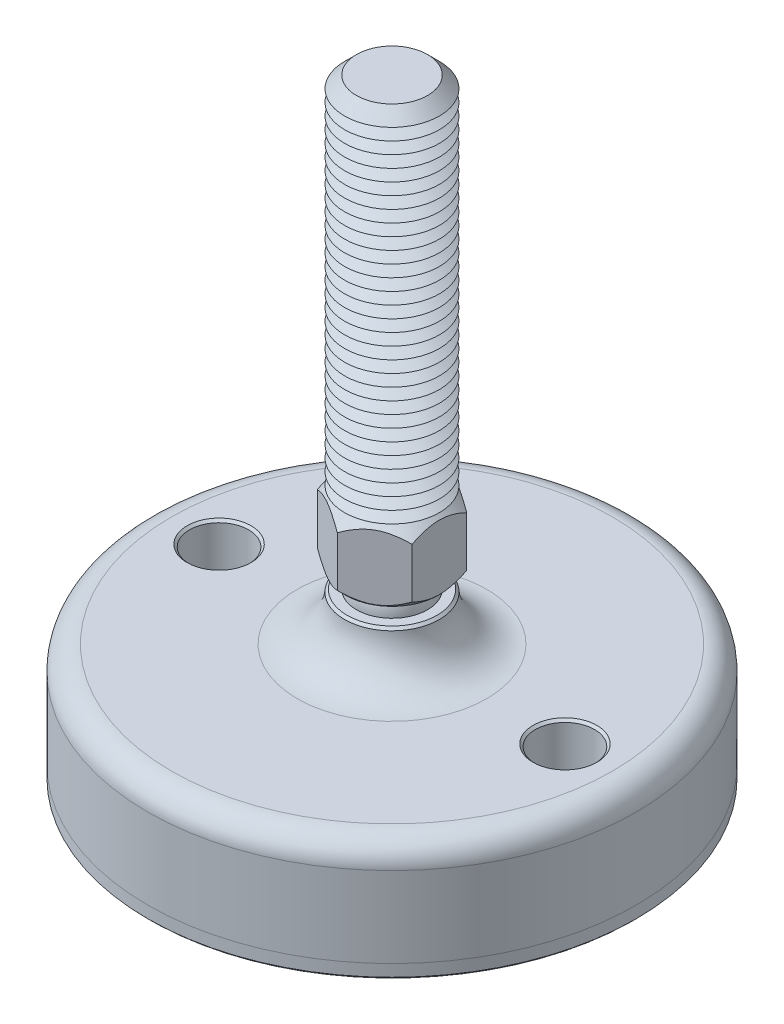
ISO-10303-21;
HEADER;
FILE_DESCRIPTION(('STEP AP214'),'2;1');
FILE_NAME('part.step','',(''),(''),'','','');
FILE_SCHEMA(('AUTOMOTIVE_DESIGN { 1 0 10303 214 1 1 1 1 }'));
ENDSEC;
DATA;
#1=APPLICATION_CONTEXT('core data for automotive mechanical design processes');
#2=APPLICATION_PROTOCOL_DEFINITION('international standard','automotive_design',2000,#1);
#3=PRODUCT_CONTEXT('',#1,'mechanical');
#4=PRODUCT('Part','Part','',(#3));
#5=PRODUCT_RELATED_PRODUCT_CATEGORY('part','',(#4));
#6=PRODUCT_DEFINITION_FORMATION('','',#4);
#7=PRODUCT_DEFINITION_CONTEXT('part definition',#1,'design');
#8=PRODUCT_DEFINITION('design','',#6,#7);
#9=PRODUCT_DEFINITION_SHAPE('','',#8);
#10=(LENGTH_UNIT() NAMED_UNIT(*) SI_UNIT(.MILLI.,.METRE.));
#11=(NAMED_UNIT(*) PLANE_ANGLE_UNIT() SI_UNIT($,.RADIAN.));
#12=(NAMED_UNIT(*) SI_UNIT($,.STERADIAN.) SOLID_ANGLE_UNIT());
#13=UNCERTAINTY_MEASURE_WITH_UNIT(LENGTH_MEASURE(1.E-05),#10,'distance_accuracy_value','');
#14=(GEOMETRIC_REPRESENTATION_CONTEXT(3) GLOBAL_UNCERTAINTY_ASSIGNED_CONTEXT((#13)) GLOBAL_UNIT_ASSIGNED_CONTEXT((#10,
#11,#12)) REPRESENTATION_CONTEXT('',''));
#15=CARTESIAN_POINT('',(0.,0.,0.));
#16=DIRECTION('',(0.,0.,1.));
#17=DIRECTION('',(1.,0.,0.));
#18=AXIS2_PLACEMENT_3D('',#15,#16,#17);
#19=CARTESIAN_POINT('',(0.,-32.,0.));
#20=DIRECTION('',(0.,1.,0.));
#21=DIRECTION('',(0.,0.,1.));
#22=AXIS2_PLACEMENT_3D('',#19,#20,#21);
#23=PLANE('',#22);
#24=CARTESIAN_POINT('',(-36.5,-32.,0.));
#25=DIRECTION('',(0.,1.,0.));
#26=DIRECTION('',(0.,0.,1.));
#27=AXIS2_PLACEMENT_3D('',#24,#25,#26);
#28=CIRCLE('',#27,6.25);
#29=CARTESIAN_POINT('',(-36.5,-32.,6.25));
#30=VERTEX_POINT('',#29);
#31=EDGE_CURVE('P0_E43',#30,#30,#28,.T.);
#32=ORIENTED_EDGE('',*,*,#31,.F.);
#33=EDGE_LOOP('',(#32));
#34=FACE_BOUND('',#33,.T.);
#35=CARTESIAN_POINT('',(36.5,-32.,0.));
#36=DIRECTION('',(0.,1.,0.));
#37=DIRECTION('',(0.,0.,1.));
#38=AXIS2_PLACEMENT_3D('',#35,#36,#37);
#39=CIRCLE('',#38,6.25);
#40=CARTESIAN_POINT('',(36.5,-32.,6.25));
#41=VERTEX_POINT('',#40);
#42=EDGE_CURVE('P0_E44',#41,#41,#39,.T.);
#43=ORIENTED_EDGE('',*,*,#42,.F.);
#44=EDGE_LOOP('',(#43));
#45=FACE_BOUND('',#44,.T.);
#46=CARTESIAN_POINT('',(0.,-32.,0.));
#47=DIRECTION('',(0.,1.,0.));
#48=DIRECTION('',(0.,0.,1.));
#49=AXIS2_PLACEMENT_3D('',#46,#47,#48);
#50=CIRCLE('',#49,51.5);
#51=CARTESIAN_POINT('',(0.,-32.,51.5));
#52=VERTEX_POINT('',#51);
#53=EDGE_CURVE('P0_E40',#52,#52,#50,.T.);
#54=ORIENTED_EDGE('',*,*,#53,.T.);
#55=EDGE_LOOP('',(#54));
#56=FACE_BOUND('',#55,.T.);
#57=ADVANCED_FACE('P0_F14',(#34,#45,#56),#23,.T.);
#58=CARTESIAN_POINT('',(0.,43.1654938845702,0.));
#59=DIRECTION('',(0.,1.,0.));
#60=DIRECTION('',(0.,0.,1.));
#61=AXIS2_PLACEMENT_3D('',#58,#59,#60);
#62=CYLINDRICAL_SURFACE('',#61,51.5);
#63=CARTESIAN_POINT('',(0.,-34.5,0.));
#64=DIRECTION('',(0.,-1.,0.));
#65=DIRECTION('',(0.,0.,-1.));
#66=AXIS2_PLACEMENT_3D('',#63,#64,#65);
#67=CIRCLE('',#66,51.5);
#68=CARTESIAN_POINT('',(0.,-34.5,-51.5));
#69=VERTEX_POINT('',#68);
#70=EDGE_CURVE('P0_E37',#69,#69,#67,.F.);
#71=ORIENTED_EDGE('',*,*,#70,.T.);
#72=EDGE_LOOP('',(#71));
#73=FACE_BOUND('',#72,.T.);
#74=ORIENTED_EDGE('',*,*,#53,.F.);
#75=EDGE_LOOP('',(#74));
#76=FACE_BOUND('',#75,.T.);
#77=ADVANCED_FACE('P0_F54',(#73,#76),#62,.T.);
#78=CARTESIAN_POINT('',(0.,-35.,51.5));
#79=DIRECTION('',(0.,-1.,0.));
#80=DIRECTION('',(0.,0.,-1.));
#81=AXIS2_PLACEMENT_3D('',#78,#79,#80);
#82=PLANE('',#81);
#83=CARTESIAN_POINT('',(36.5,-35.,0.));
#84=DIRECTION('',(0.,-1.,0.));
#85=DIRECTION('',(0.,0.,-1.));
#86=AXIS2_PLACEMENT_3D('',#83,#84,#85);
#87=CIRCLE('',#86,6.75000000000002);
#88=CARTESIAN_POINT('',(36.5,-35.,-6.75000000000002));
#89=VERTEX_POINT('',#88);
#90=EDGE_CURVE('P0_E25',#89,#89,#87,.F.);
#91=ORIENTED_EDGE('',*,*,#90,.T.);
#92=EDGE_LOOP('',(#91));
#93=FACE_BOUND('',#92,.T.);
#94=CARTESIAN_POINT('',(-36.5,-35.,0.));
#95=DIRECTION('',(0.,-1.,0.));
#96=DIRECTION('',(0.,0.,-1.));
#97=AXIS2_PLACEMENT_3D('',#94,#95,#96);
#98=CIRCLE('',#97,6.74999999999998);
#99=CARTESIAN_POINT('',(-36.5,-35.,-6.74999999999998));
#100=VERTEX_POINT('',#99);
#101=EDGE_CURVE('P0_E29',#100,#100,#98,.F.);
#102=ORIENTED_EDGE('',*,*,#101,.T.);
#103=EDGE_LOOP('',(#102));
#104=FACE_BOUND('',#103,.T.);
#105=CARTESIAN_POINT('',(0.,-35.,0.));
#106=DIRECTION('',(0.,-1.,0.));
#107=DIRECTION('',(0.,0.,-1.));
#108=AXIS2_PLACEMENT_3D('',#105,#106,#107);
#109=CIRCLE('',#108,51.);
#110=CARTESIAN_POINT('',(0.,-35.,-51.));
#111=VERTEX_POINT('',#110);
#112=EDGE_CURVE('P0_E34',#111,#111,#109,.T.);
#113=ORIENTED_EDGE('',*,*,#112,.T.);
#114=EDGE_LOOP('',(#113));
#115=FACE_BOUND('',#114,.T.);
#116=ADVANCED_FACE('P0_F61',(#93,#104,#115),#82,.T.);
#117=CARTESIAN_POINT('',(0.,-34.5,0.));
#118=DIRECTION('',(0.,1.,0.));
#119=DIRECTION('',(0.,0.,1.));
#120=AXIS2_PLACEMENT_3D('',#117,#118,#119);
#121=CONICAL_SURFACE('',#120,51.5,0.785398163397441);
#122=ORIENTED_EDGE('',*,*,#112,.F.);
#123=EDGE_LOOP('',(#122));
#124=FACE_BOUND('',#123,.T.);
#125=ORIENTED_EDGE('',*,*,#70,.F.);
#126=EDGE_LOOP('',(#125));
#127=FACE_BOUND('',#126,.T.);
#128=ADVANCED_FACE('P0_F68',(#124,#127),#121,.T.);
#129=CARTESIAN_POINT('',(36.5,-35.,0.));
#130=DIRECTION('',(0.,1.,0.));
#131=DIRECTION('',(0.,0.,1.));
#132=AXIS2_PLACEMENT_3D('',#129,#130,#131);
#133=CYLINDRICAL_SURFACE('',#132,6.25);
#134=CARTESIAN_POINT('',(36.5,-34.5,0.));
#135=DIRECTION('',(0.,-1.,0.));
#136=DIRECTION('',(0.,0.,-1.));
#137=AXIS2_PLACEMENT_3D('',#134,#135,#136);
#138=CIRCLE('',#137,6.25);
#139=CARTESIAN_POINT('',(36.5,-34.5,-6.25));
#140=VERTEX_POINT('',#139);
#141=EDGE_CURVE('P0_E21',#140,#140,#138,.T.);
#142=ORIENTED_EDGE('',*,*,#141,.T.);
#143=EDGE_LOOP('',(#142));
#144=FACE_BOUND('',#143,.T.);
#145=ORIENTED_EDGE('',*,*,#42,.T.);
#146=EDGE_LOOP('',(#145));
#147=FACE_BOUND('',#146,.T.);
#148=ADVANCED_FACE('P0_F74',(#144,#147),#133,.F.);
#149=CARTESIAN_POINT('',(-36.5,-35.,0.));
#150=DIRECTION('',(0.,1.,0.));
#151=DIRECTION('',(0.,0.,1.));
#152=AXIS2_PLACEMENT_3D('',#149,#150,#151);
#153=CYLINDRICAL_SURFACE('',#152,6.25);
#154=CARTESIAN_POINT('',(-36.5,-34.5,0.));
#155=DIRECTION('',(0.,-1.,0.));
#156=DIRECTION('',(0.,0.,-1.));
#157=AXIS2_PLACEMENT_3D('',#154,#155,#156);
#158=CIRCLE('',#157,6.25);
#159=CARTESIAN_POINT('',(-36.5,-34.5,-6.25));
#160=VERTEX_POINT('',#159);
#161=EDGE_CURVE('P0_E10',#160,#160,#158,.T.);
#162=ORIENTED_EDGE('',*,*,#161,.T.);
#163=EDGE_LOOP('',(#162));
#164=FACE_BOUND('',#163,.T.);
#165=ORIENTED_EDGE('',*,*,#31,.T.);
#166=EDGE_LOOP('',(#165));
#167=FACE_BOUND('',#166,.T.);
#168=ADVANCED_FACE('P0_F50',(#164,#167),#153,.F.);
#169=CARTESIAN_POINT('',(36.5,-35.,0.));
#170=DIRECTION('',(0.,-1.,0.));
#171=DIRECTION('',(0.,0.,-1.));
#172=AXIS2_PLACEMENT_3D('',#169,#170,#171);
#173=CONICAL_SURFACE('',#172,6.75000000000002,0.785398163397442);
#174=ORIENTED_EDGE('',*,*,#141,.F.);
#175=EDGE_LOOP('',(#174));
#176=FACE_BOUND('',#175,.T.);
#177=ORIENTED_EDGE('',*,*,#90,.F.);
#178=EDGE_LOOP('',(#177));
#179=FACE_BOUND('',#178,.T.);
#180=ADVANCED_FACE('P0_F76',(#176,#179),#173,.F.);
#181=CARTESIAN_POINT('',(-36.5,-35.,0.));
#182=DIRECTION('',(0.,-1.,0.));
#183=DIRECTION('',(0.,0.,-1.));
#184=AXIS2_PLACEMENT_3D('',#181,#182,#183);
#185=CONICAL_SURFACE('',#184,6.74999999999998,0.785398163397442);
#186=ORIENTED_EDGE('',*,*,#161,.F.);
#187=EDGE_LOOP('',(#186));
#188=FACE_BOUND('',#187,.T.);
#189=ORIENTED_EDGE('',*,*,#101,.F.);
#190=EDGE_LOOP('',(#189));
#191=FACE_BOUND('',#190,.T.);
#192=ADVANCED_FACE('P0_F16',(#188,#191),#185,.F.);
#193=CLOSED_SHELL('',(#57,#77,#116,#128,#148,#168,#180,#192));
#194=MANIFOLD_SOLID_BREP('P0_B1',#193);
#195=CARTESIAN_POINT('',(0.,3.75,0.));
#196=DIRECTION('',(0.,1.,0.));
#197=DIRECTION('',(0.,0.,1.));
#198=AXIS2_PLACEMENT_3D('',#195,#196,#197);
#199=PLANE('',#198);
#200=CARTESIAN_POINT('',(0.,3.75,0.));
#201=DIRECTION('',(0.,1.,0.));
#202=DIRECTION('',(0.,0.,1.));
#203=AXIS2_PLACEMENT_3D('',#200,#201,#202);
#204=CIRCLE('',#203,9.72829454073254);
#205=CARTESIAN_POINT('',(0.,3.75,9.72829454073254));
#206=VERTEX_POINT('',#205);
#207=EDGE_CURVE('P1_E211',#206,#206,#204,.T.);
#208=ORIENTED_EDGE('',*,*,#207,.F.);
#209=EDGE_LOOP('',(#208));
#210=FACE_BOUND('',#209,.T.);
#211=CARTESIAN_POINT('',(0.,3.75,0.));
#212=DIRECTION('',(0.,1.,0.));
#213=DIRECTION('',(0.,0.,1.));
#214=AXIS2_PLACEMENT_3D('',#211,#212,#213);
#215=CIRCLE('',#214,6.49519052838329);
#216=CARTESIAN_POINT('',(0.,3.75,6.49519052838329));
#217=VERTEX_POINT('',#216);
#218=EDGE_CURVE('P1_E24',#217,#217,#215,.F.);
#219=ORIENTED_EDGE('',*,*,#218,.F.);
#220=EDGE_LOOP('',(#219));
#221=FACE_BOUND('',#220,.T.);
#222=ADVANCED_FACE('P1_F16',(#210,#221),#199,.F.);
#223=CARTESIAN_POINT('',(0.,0.,0.));
#224=DIRECTION('',(0.,1.,0.));
#225=DIRECTION('',(0.,0.,-1.));
#226=AXIS2_PLACEMENT_3D('',#223,#224,#225);
#227=SPHERICAL_SURFACE('',#226,7.5);
#228=ORIENTED_EDGE('',*,*,#218,.T.);
#229=EDGE_LOOP('',(#228));
#230=FACE_BOUND('',#229,.T.);
#231=ADVANCED_FACE('P1_F201',(#230),#227,.T.);
#232=CARTESIAN_POINT('',(0.,3.75,0.));
#233=DIRECTION('',(0.,1.,0.));
#234=DIRECTION('',(0.,0.,1.));
#235=AXIS2_PLACEMENT_3D('',#232,#233,#234);
#236=CONICAL_SURFACE('',#235,9.72829454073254,0.785398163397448);
#237=ORIENTED_EDGE('',*,*,#207,.T.);
#238=EDGE_LOOP('',(#237));
#239=FACE_BOUND('',#238,.T.);
#240=CARTESIAN_POINT('',(-10.,9.59571642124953,-11.9394228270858));
#241=CARTESIAN_POINT('',(-10.,9.37430561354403,-11.6505452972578));
#242=CARTESIAN_POINT('',(-10.,9.15490936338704,-11.3600988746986));
#243=CARTESIAN_POINT('',(-10.,8.72106267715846,-10.7754314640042));
#244=CARTESIAN_POINT('',(-10.,8.50661343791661,-10.4812095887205));
#245=CARTESIAN_POINT('',(-10.,8.08205114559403,-9.88620330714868));
#246=CARTESIAN_POINT('',(-10.,7.87198437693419,-9.58538576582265));
#247=CARTESIAN_POINT('',(-10.,7.45926520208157,-8.97872312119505));
#248=CARTESIAN_POINT('',(-10.,7.25661228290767,-8.67287836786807));
#249=CARTESIAN_POINT('',(-10.,6.84809543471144,-8.03614350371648));
#250=CARTESIAN_POINT('',(-10.,6.64281401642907,-7.70487777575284));
#251=CARTESIAN_POINT('',(-10.,6.245142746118,-7.03457466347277));
#252=CARTESIAN_POINT('',(-10.,6.0527550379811,-6.69553599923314));
#253=CARTESIAN_POINT('',(-10.,5.68497951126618,-6.00961937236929));
#254=CARTESIAN_POINT('',(-10.,5.50954176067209,-5.66276839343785));
#255=CARTESIAN_POINT('',(-10.,5.17959635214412,-4.95932933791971));
#256=CARTESIAN_POINT('',(-10.,5.02507889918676,-4.60274591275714));
#257=CARTESIAN_POINT('',(-10.,4.75599518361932,-3.91353381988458));
#258=CARTESIAN_POINT('',(-10.,4.63902686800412,-3.58185263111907));
#259=CARTESIAN_POINT('',(-10.,4.43164927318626,-2.91013341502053));
#260=CARTESIAN_POINT('',(-10.,4.34124171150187,-2.57009484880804));
#261=CARTESIAN_POINT('',(-10.,4.19334931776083,-1.88955843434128));
#262=CARTESIAN_POINT('',(-10.,4.13527351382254,-1.54919119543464));
#263=CARTESIAN_POINT('',(-10.,4.05324021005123,-0.864347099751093));
#264=CARTESIAN_POINT('',(-10.,4.029275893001,-0.519871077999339));
#265=CARTESIAN_POINT('',(-10.,4.01745435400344,0.155191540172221));
#266=CARTESIAN_POINT('',(-10.,4.02812008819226,0.485752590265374));
#267=CARTESIAN_POINT('',(-10.,4.08160326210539,1.1442457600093));
#268=CARTESIAN_POINT('',(-10.,4.12442366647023,1.47217763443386));
#269=CARTESIAN_POINT('',(-10.,4.24054019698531,2.12859326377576));
#270=CARTESIAN_POINT('',(-10.,4.31437036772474,2.45698095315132));
#271=CARTESIAN_POINT('',(-10.,4.48844287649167,3.10654175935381));
#272=CARTESIAN_POINT('',(-10.,4.58868356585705,3.42771532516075));
#273=CARTESIAN_POINT('',(-10.,4.81839210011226,4.08271396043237));
#274=CARTESIAN_POINT('',(-10.,4.94932842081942,4.41601827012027));
#275=CARTESIAN_POINT('',(-10.,5.23140828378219,5.07403931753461));
#276=CARTESIAN_POINT('',(-10.,5.38256099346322,5.3987520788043));
#277=CARTESIAN_POINT('',(-10.,5.70148727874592,6.04113299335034));
#278=CARTESIAN_POINT('',(-10.,5.86931223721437,6.35877542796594));
#279=CARTESIAN_POINT('',(-10.,6.21788686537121,6.98677627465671));
#280=CARTESIAN_POINT('',(-10.,6.39863453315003,7.29713580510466));
#281=CARTESIAN_POINT('',(-10.,6.76133545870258,7.89633938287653));
#282=CARTESIAN_POINT('',(-10.,6.94278731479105,8.18548854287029));
#283=CARTESIAN_POINT('',(-10.,7.31339871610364,8.75881961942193));
#284=CARTESIAN_POINT('',(-10.,7.50255884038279,9.04300116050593));
#285=CARTESIAN_POINT('',(-10.,7.8856676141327,9.6047584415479));
#286=CARTESIAN_POINT('',(-10.,8.07956548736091,9.88236893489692));
#287=CARTESIAN_POINT('',(-10.,8.47254700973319,10.4337838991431));
#288=CARTESIAN_POINT('',(-10.,8.67162921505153,10.7075893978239));
#289=CARTESIAN_POINT('',(-10.,8.87283307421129,10.9797992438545));
#290=B_SPLINE_CURVE_WITH_KNOTS('',3,(#240,#241,#242,#243,#244,#245,#246,#247,#248,#249,#250,
#251,#252,#253,#254,#255,#256,#257,#258,#259,#260,#261,#262,#263,#264,#265,#266,#267,#268,#269,
#270,#271,#272,#273,#274,#275,#276,#277,#278,#279,#280,#281,#282,#283,#284,#285,#286,#287,#288,
#289),.UNSPECIFIED.,.F.,.F.,(4,2,2,2,2,2,2,2,2,2,2,2,2,2,2,2,2,2,2,2,2,2,2,2,4),(0.,
1.09192545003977,2.18411235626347,3.28473497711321,4.3852812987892,5.5541916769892,
6.72329593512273,7.88884387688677,9.05384420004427,10.1080362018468,11.1622963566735,
12.1965943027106,13.2306855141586,14.2212593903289,15.2119246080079,16.2203997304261,
17.2288119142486,18.3022883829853,19.3762532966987,20.4536373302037,21.5308548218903,
22.5548150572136,23.5788523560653,24.5946500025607,25.6101677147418),.UNSPECIFIED.);
#291=CARTESIAN_POINT('',(-10.,5.56871084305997,-5.77350269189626));
#292=VERTEX_POINT('',#291);
#293=CARTESIAN_POINT('',(-10.,5.56871084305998,5.77350269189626));
#294=VERTEX_POINT('',#293);
#295=EDGE_CURVE('P1_E185',#292,#294,#290,.T.);
#296=ORIENTED_EDGE('',*,*,#295,.F.);
#297=CARTESIAN_POINT('',(0.000199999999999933,5.56882631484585,-11.5471208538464));
#298=CARTESIAN_POINT('',(-0.171722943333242,5.4695807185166,-11.447861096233));
#299=CARTESIAN_POINT('',(-0.344992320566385,5.37336355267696,-11.3478239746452));
#300=CARTESIAN_POINT('',(-0.694433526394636,5.18794806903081,-11.1460740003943));
#301=CARTESIAN_POINT('',(-0.870606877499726,5.09875358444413,-11.0443602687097));
#302=CARTESIAN_POINT('',(-1.22689656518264,4.92796770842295,-10.8386563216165));
#303=CARTESIAN_POINT('',(-1.40702970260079,4.84642277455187,-10.7346564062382));
#304=CARTESIAN_POINT('',(-1.77025459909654,4.69270708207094,-10.52494841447));
#305=CARTESIAN_POINT('',(-1.95334590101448,4.62053489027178,-10.4192406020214));
#306=CARTESIAN_POINT('',(-2.31954331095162,4.4878482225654,-10.2078164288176));
#307=CARTESIAN_POINT('',(-2.50260441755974,4.42716910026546,-10.1021260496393));
#308=CARTESIAN_POINT('',(-2.87129282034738,4.31731511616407,-9.88926370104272));
#309=CARTESIAN_POINT('',(-3.05691983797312,4.26813901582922,-9.78209189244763));
#310=CARTESIAN_POINT('',(-3.42994608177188,4.1825291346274,-9.56672509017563));
#311=CARTESIAN_POINT('',(-3.61734032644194,4.14606667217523,-9.45853297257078));
#312=CARTESIAN_POINT('',(-3.99370204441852,4.08668528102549,-9.24124043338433));
#313=CARTESIAN_POINT('',(-4.1826692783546,4.06376432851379,-9.13214015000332));
#314=CARTESIAN_POINT('',(-4.64316633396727,4.0253323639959,-8.86627205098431));
#315=CARTESIAN_POINT('',(-4.91519388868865,4.01726744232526,-8.70921686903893));
#316=CARTESIAN_POINT('',(-5.45875701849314,4.03080424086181,-8.39539054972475));
#317=CARTESIAN_POINT('',(-5.7302923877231,4.05241636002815,-8.23861953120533));
#318=CARTESIAN_POINT('',(-6.27080349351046,4.12403157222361,-7.92655529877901));
#319=CARTESIAN_POINT('',(-6.53977602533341,4.17406641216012,-7.77126393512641));
#320=CARTESIAN_POINT('',(-7.07309796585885,4.29980733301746,-7.46335036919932));
#321=CARTESIAN_POINT('',(-7.33744772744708,4.3755114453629,-7.31072796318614));
#322=CARTESIAN_POINT('',(-7.80670351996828,4.53125365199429,-7.03980300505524));
#323=CARTESIAN_POINT('',(-8.01264886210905,4.60719488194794,-6.92090040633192));
#324=CARTESIAN_POINT('',(-8.42084280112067,4.77131434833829,-6.68522952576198));
#325=CARTESIAN_POINT('',(-8.62309128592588,4.85949295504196,-6.5684613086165));
#326=CARTESIAN_POINT('',(-9.02325448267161,5.04611070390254,-6.33742697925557));
#327=CARTESIAN_POINT('',(-9.22118057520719,5.1445175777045,-6.2231542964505));
#328=CARTESIAN_POINT('',(-9.61336795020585,5.35030005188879,-5.99672480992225));
#329=CARTESIAN_POINT('',(-9.80763139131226,5.45767015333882,-5.88456675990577));
#330=CARTESIAN_POINT('',(-10.0002,5.56882631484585,-5.77338722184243));
#331=B_SPLINE_CURVE_WITH_KNOTS('',3,(#297,#298,#299,#300,#301,#302,#303,#304,#305,#306,#307,
#308,#309,#310,#311,#312,#313,#314,#315,#316,#317,#318,#319,#320,#321,#322,#323,#324,#325,#326,
#327,#328,#329,#330),.UNSPECIFIED.,.F.,.F.,(4,2,2,2,2,2,2,2,2,2,2,2,2,2,2,2,4),(0.,
0.665863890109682,1.33208874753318,2.00212824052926,2.67206515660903,3.33152613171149,
3.99091606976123,4.64880867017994,5.30660292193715,6.24777541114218,7.18927777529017,
8.13183382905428,9.07431761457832,9.82287578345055,10.5714566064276,11.3177436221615,
12.0635761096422),.UNSPECIFIED.);
#332=CARTESIAN_POINT('',(0.,5.56871084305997,-11.5470053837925));
#333=VERTEX_POINT('',#332);
#334=EDGE_CURVE('P1_E179',#333,#292,#331,.T.);
#335=ORIENTED_EDGE('',*,*,#334,.F.);
#336=CARTESIAN_POINT('',(10.0002,5.56882631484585,-5.77338722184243));
#337=CARTESIAN_POINT('',(9.82827705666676,5.4695807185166,-5.87264697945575));
#338=CARTESIAN_POINT('',(9.65500767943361,5.37336355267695,-5.97268410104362));
#339=CARTESIAN_POINT('',(9.30556647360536,5.18794806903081,-6.17443407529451));
#340=CARTESIAN_POINT('',(9.12939312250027,5.09875358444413,-6.27614780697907));
#341=CARTESIAN_POINT('',(8.77310343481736,4.92796770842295,-6.48185175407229));
#342=CARTESIAN_POINT('',(8.59297029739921,4.84642277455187,-6.58585166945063));
#343=CARTESIAN_POINT('',(8.22974540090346,4.69270708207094,-6.79555966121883));
#344=CARTESIAN_POINT('',(8.04665409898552,4.62053489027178,-6.90126747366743));
#345=CARTESIAN_POINT('',(7.68045668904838,4.4878482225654,-7.11269164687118));
#346=CARTESIAN_POINT('',(7.49739558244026,4.42716910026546,-7.21838202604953));
#347=CARTESIAN_POINT('',(7.12870717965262,4.31731511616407,-7.43124437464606));
#348=CARTESIAN_POINT('',(6.94308016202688,4.26813901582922,-7.53841618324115));
#349=CARTESIAN_POINT('',(6.57005391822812,4.1825291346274,-7.75378298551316));
#350=CARTESIAN_POINT('',(6.38265967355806,4.14606667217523,-7.861975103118));
#351=CARTESIAN_POINT('',(6.00629795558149,4.08668528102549,-8.07926764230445));
#352=CARTESIAN_POINT('',(5.81733072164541,4.06376432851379,-8.18836792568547));
#353=CARTESIAN_POINT('',(5.35683366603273,4.0253323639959,-8.45423602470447));
#354=CARTESIAN_POINT('',(5.08480611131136,4.01726744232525,-8.61129120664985));
#355=CARTESIAN_POINT('',(4.54124298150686,4.03080424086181,-8.92511752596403));
#356=CARTESIAN_POINT('',(4.2697076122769,4.05241636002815,-9.08188854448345));
#357=CARTESIAN_POINT('',(3.72919650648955,4.12403157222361,-9.39395277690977));
#358=CARTESIAN_POINT('',(3.46022397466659,4.17406641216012,-9.54924414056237));
#359=CARTESIAN_POINT('',(2.92690203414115,4.29980733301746,-9.85715770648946));
#360=CARTESIAN_POINT('',(2.66255227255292,4.37551144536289,-10.0097801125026));
#361=CARTESIAN_POINT('',(2.19329648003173,4.53125365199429,-10.2807050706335));
#362=CARTESIAN_POINT('',(1.98735113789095,4.60719488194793,-10.3996076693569));
#363=CARTESIAN_POINT('',(1.57915719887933,4.77131434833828,-10.6352785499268));
#364=CARTESIAN_POINT('',(1.37690871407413,4.85949295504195,-10.7520467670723));
#365=CARTESIAN_POINT('',(0.976745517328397,5.04611070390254,-10.9830810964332));
#366=CARTESIAN_POINT('',(0.77881942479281,5.1445175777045,-11.0973537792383));
#367=CARTESIAN_POINT('',(0.386632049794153,5.35030005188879,-11.3237832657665));
#368=CARTESIAN_POINT('',(0.192368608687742,5.45767015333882,-11.435941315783));
#369=CARTESIAN_POINT('',(-0.000199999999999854,5.56882631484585,-11.5471208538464));
#370=B_SPLINE_CURVE_WITH_KNOTS('',3,(#336,#337,#338,#339,#340,#341,#342,#343,#344,#345,#346,
#347,#348,#349,#350,#351,#352,#353,#354,#355,#356,#357,#358,#359,#360,#361,#362,#363,#364,#365,
#366,#367,#368,#369),.UNSPECIFIED.,.F.,.F.,(4,2,2,2,2,2,2,2,2,2,2,2,2,2,2,2,4),(0.,
0.665863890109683,1.33208874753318,2.00212824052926,2.67206515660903,3.33152613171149,
3.99091606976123,4.64880867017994,5.30660292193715,6.24777541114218,7.18927777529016,
8.13183382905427,9.07431761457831,9.82287578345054,10.5714566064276,11.3177436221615,
12.0635761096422),.UNSPECIFIED.);
#371=CARTESIAN_POINT('',(9.99999999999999,5.56871084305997,-5.77350269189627));
#372=VERTEX_POINT('',#371);
#373=EDGE_CURVE('P1_E167',#372,#333,#370,.T.);
#374=ORIENTED_EDGE('',*,*,#373,.F.);
#375=CARTESIAN_POINT('',(10.,9.59571642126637,-11.9394228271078));
#376=CARTESIAN_POINT('',(10.,9.37430561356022,-11.6505452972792));
#377=CARTESIAN_POINT('',(10.,9.15490936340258,-11.3600988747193));
#378=CARTESIAN_POINT('',(10.,8.7210626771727,-10.7754314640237));
#379=CARTESIAN_POINT('',(10.,8.5066134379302,-10.4812095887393));
#380=CARTESIAN_POINT('',(10.,8.08205114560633,-9.88620330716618));
#381=CARTESIAN_POINT('',(10.,7.87198437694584,-9.58538576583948));
#382=CARTESIAN_POINT('',(10.,7.45926520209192,-8.97872312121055));
#383=CARTESIAN_POINT('',(10.,7.25661228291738,-8.67287836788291));
#384=CARTESIAN_POINT('',(10.,6.84809543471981,-8.03614350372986));
#385=CARTESIAN_POINT('',(10.,6.64281401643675,-7.70487777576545));
#386=CARTESIAN_POINT('',(10.,6.24514274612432,-7.03457466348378));
#387=CARTESIAN_POINT('',(10.,6.05275503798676,-6.69553599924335));
#388=CARTESIAN_POINT('',(10.,5.68497951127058,-6.00961937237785));
#389=CARTESIAN_POINT('',(10.,5.50954176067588,-5.66276839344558));
#390=CARTESIAN_POINT('',(10.,5.17959635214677,-4.95932933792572));
#391=CARTESIAN_POINT('',(10.,5.02507889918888,-4.60274591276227));
#392=CARTESIAN_POINT('',(10.,4.75599518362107,-3.91353381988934));
#393=CARTESIAN_POINT('',(10.,4.63902686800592,-3.58185263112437));
#394=CARTESIAN_POINT('',(10.,4.43164927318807,-2.91013341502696));
#395=CARTESIAN_POINT('',(10.,4.34124171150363,-2.57009484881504));
#396=CARTESIAN_POINT('',(10.,4.19334931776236,-1.8895584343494));
#397=CARTESIAN_POINT('',(10.,4.13527351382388,-1.54919119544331));
#398=CARTESIAN_POINT('',(10.,4.05324021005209,-0.86434709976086));
#399=CARTESIAN_POINT('',(10.,4.02927589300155,-0.519871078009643));
#400=CARTESIAN_POINT('',(10.,4.01745435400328,0.155191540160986));
#401=CARTESIAN_POINT('',(10.,4.0281200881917,0.485752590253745));
#402=CARTESIAN_POINT('',(10.,4.08160326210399,1.14424575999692));
#403=CARTESIAN_POINT('',(10.,4.12442366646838,1.47217763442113));
#404=CARTESIAN_POINT('',(10.,4.24054019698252,2.12859326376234));
#405=CARTESIAN_POINT('',(10.,4.31437036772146,2.45698095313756));
#406=CARTESIAN_POINT('',(10.,4.48844287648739,3.1065417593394));
#407=CARTESIAN_POINT('',(10.,4.58868356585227,3.42771532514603));
#408=CARTESIAN_POINT('',(10.,4.81839210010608,4.08271396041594));
#409=CARTESIAN_POINT('',(10.,4.94932842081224,4.41601827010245));
#410=CARTESIAN_POINT('',(10.,5.23140828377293,5.0740393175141));
#411=CARTESIAN_POINT('',(10.,5.38256099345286,5.39875207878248));
#412=CARTESIAN_POINT('',(10.,5.70148727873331,6.04113299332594));
#413=CARTESIAN_POINT('',(10.,5.86931223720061,6.35877542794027));
#414=CARTESIAN_POINT('',(10.,6.21788686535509,6.98677627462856));
#415=CARTESIAN_POINT('',(10.,6.39863453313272,7.29713580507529));
#416=CARTESIAN_POINT('',(10.,6.761335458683,7.89633938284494));
#417=CARTESIAN_POINT('',(10.,6.9427873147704,8.18548854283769));
#418=CARTESIAN_POINT('',(10.,7.31339871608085,8.75881961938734));
#419=CARTESIAN_POINT('',(10.,7.50255884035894,9.04300116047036));
#420=CARTESIAN_POINT('',(10.,7.88566761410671,9.60475844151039));
#421=CARTESIAN_POINT('',(10.,8.07956548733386,9.88236893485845));
#422=CARTESIAN_POINT('',(10.,8.47254700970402,10.4337838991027));
#423=CARTESIAN_POINT('',(10.,8.6716292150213,10.7075893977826));
#424=CARTESIAN_POINT('',(10.,8.87283307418,10.9797992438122));
#425=B_SPLINE_CURVE_WITH_KNOTS('',3,(#375,#376,#377,#378,#379,#380,#381,#382,#383,#384,#385,
#386,#387,#388,#389,#390,#391,#392,#393,#394,#395,#396,#397,#398,#399,#400,#401,#402,#403,#404,
#405,#406,#407,#408,#409,#410,#411,#412,#413,#414,#415,#416,#417,#418,#419,#420,#421,#422,#423,
#424),.UNSPECIFIED.,.F.,.F.,(4,2,2,2,2,2,2,2,2,2,2,2,2,2,2,2,2,2,2,2,2,2,2,2,4),(0.,
1.09192545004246,2.18411235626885,3.28473497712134,4.38528129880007,5.55419167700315,
6.72329593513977,7.88884387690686,9.05384420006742,10.1080362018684,11.1622963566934,
12.196594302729,13.2306855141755,14.2212593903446,15.2119246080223,16.2203997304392,
17.2288119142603,18.3022883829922,19.3762532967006,20.4536373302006,21.5308548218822,
22.5548150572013,23.5788523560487,24.5946500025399,25.6101677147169),.UNSPECIFIED.);
#426=CARTESIAN_POINT('',(10.,5.56871084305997,5.77350269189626));
#427=VERTEX_POINT('',#426);
#428=EDGE_CURVE('P1_E70',#427,#372,#425,.F.);
#429=ORIENTED_EDGE('',*,*,#428,.F.);
#430=CARTESIAN_POINT('',(-0.000200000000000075,5.56882631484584,11.5471208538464));
#431=CARTESIAN_POINT('',(0.171722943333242,5.4695807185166,11.447861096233));
#432=CARTESIAN_POINT('',(0.344992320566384,5.37336355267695,11.3478239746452));
#433=CARTESIAN_POINT('',(0.694433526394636,5.18794806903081,11.1460740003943));
#434=CARTESIAN_POINT('',(0.870606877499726,5.09875358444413,11.0443602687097));
#435=CARTESIAN_POINT('',(1.22689656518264,4.92796770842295,10.8386563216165));
#436=CARTESIAN_POINT('',(1.40702970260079,4.84642277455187,10.7346564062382));
#437=CARTESIAN_POINT('',(1.77025459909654,4.69270708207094,10.52494841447));
#438=CARTESIAN_POINT('',(1.95334590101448,4.62053489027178,10.4192406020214));
#439=CARTESIAN_POINT('',(2.31954331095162,4.4878482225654,10.2078164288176));
#440=CARTESIAN_POINT('',(2.50260441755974,4.42716910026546,10.1021260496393));
#441=CARTESIAN_POINT('',(2.87129282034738,4.31731511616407,9.88926370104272));
#442=CARTESIAN_POINT('',(3.05691983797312,4.26813901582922,9.78209189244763));
#443=CARTESIAN_POINT('',(3.42994608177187,4.18252913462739,9.56672509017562));
#444=CARTESIAN_POINT('',(3.61734032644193,4.14606667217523,9.45853297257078));
#445=CARTESIAN_POINT('',(3.99370204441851,4.08668528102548,9.24124043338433));
#446=CARTESIAN_POINT('',(4.18266927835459,4.06376432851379,9.13214015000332));
#447=CARTESIAN_POINT('',(4.64316633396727,4.0253323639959,8.86627205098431));
#448=CARTESIAN_POINT('',(4.91519388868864,4.01726744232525,8.70921686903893));
#449=CARTESIAN_POINT('',(5.45875701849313,4.03080424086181,8.39539054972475));
#450=CARTESIAN_POINT('',(5.7302923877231,4.05241636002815,8.23861953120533));
#451=CARTESIAN_POINT('',(6.27080349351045,4.1240315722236,7.92655529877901));
#452=CARTESIAN_POINT('',(6.53977602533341,4.17406641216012,7.77126393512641));
#453=CARTESIAN_POINT('',(7.07309796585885,4.29980733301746,7.46335036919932));
#454=CARTESIAN_POINT('',(7.33744772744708,4.37551144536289,7.31072796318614));
#455=CARTESIAN_POINT('',(7.80670351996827,4.53125365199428,7.03980300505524));
#456=CARTESIAN_POINT('',(8.01264886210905,4.60719488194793,6.92090040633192));
#457=CARTESIAN_POINT('',(8.42084280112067,4.77131434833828,6.68522952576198));
#458=CARTESIAN_POINT('',(8.62309128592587,4.85949295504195,6.5684613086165));
#459=CARTESIAN_POINT('',(9.0232544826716,5.04611070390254,6.33742697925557));
#460=CARTESIAN_POINT('',(9.22118057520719,5.1445175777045,6.2231542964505));
#461=CARTESIAN_POINT('',(9.61336795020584,5.35030005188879,5.99672480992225));
#462=CARTESIAN_POINT('',(9.80763139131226,5.45767015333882,5.88456675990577));
#463=CARTESIAN_POINT('',(10.0002,5.56882631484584,5.77338722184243));
#464=B_SPLINE_CURVE_WITH_KNOTS('',3,(#430,#431,#432,#433,#434,#435,#436,#437,#438,#439,#440,
#441,#442,#443,#444,#445,#446,#447,#448,#449,#450,#451,#452,#453,#454,#455,#456,#457,#458,#459,
#460,#461,#462,#463),.UNSPECIFIED.,.F.,.F.,(4,2,2,2,2,2,2,2,2,2,2,2,2,2,2,2,4),(0.,
0.665863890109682,1.33208874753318,2.00212824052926,2.67206515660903,3.33152613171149,
3.99091606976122,4.64880867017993,5.30660292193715,6.24777541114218,7.18927777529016,
8.13183382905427,9.07431761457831,9.82287578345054,10.5714566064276,11.3177436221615,
12.0635761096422),.UNSPECIFIED.);
#465=CARTESIAN_POINT('',(0.,5.56871084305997,11.5470053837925));
#466=VERTEX_POINT('',#465);
#467=EDGE_CURVE('P1_E67',#466,#427,#464,.T.);
#468=ORIENTED_EDGE('',*,*,#467,.F.);
#469=CARTESIAN_POINT('',(-10.0002,5.56882631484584,5.77338722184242));
#470=CARTESIAN_POINT('',(-9.82827705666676,5.4695807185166,5.87264697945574));
#471=CARTESIAN_POINT('',(-9.65500767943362,5.37336355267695,5.97268410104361));
#472=CARTESIAN_POINT('',(-9.30556647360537,5.18794806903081,6.1744340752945));
#473=CARTESIAN_POINT('',(-9.12939312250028,5.09875358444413,6.27614780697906));
#474=CARTESIAN_POINT('',(-8.77310343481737,4.92796770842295,6.48185175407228));
#475=CARTESIAN_POINT('',(-8.59297029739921,4.84642277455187,6.58585166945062));
#476=CARTESIAN_POINT('',(-8.22974540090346,4.69270708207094,6.79555966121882));
#477=CARTESIAN_POINT('',(-8.04665409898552,4.62053489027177,6.90126747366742));
#478=CARTESIAN_POINT('',(-7.68045668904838,4.48784822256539,7.11269164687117));
#479=CARTESIAN_POINT('',(-7.49739558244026,4.42716910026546,7.21838202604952));
#480=CARTESIAN_POINT('',(-7.12870717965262,4.31731511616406,7.43124437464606));
#481=CARTESIAN_POINT('',(-6.94308016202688,4.26813901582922,7.53841618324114));
#482=CARTESIAN_POINT('',(-6.57005391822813,4.18252913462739,7.75378298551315));
#483=CARTESIAN_POINT('',(-6.38265967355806,4.14606667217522,7.861975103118));
#484=CARTESIAN_POINT('',(-6.00629795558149,4.08668528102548,8.07926764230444));
#485=CARTESIAN_POINT('',(-5.81733072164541,4.06376432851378,8.18836792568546));
#486=CARTESIAN_POINT('',(-5.35683366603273,4.0253323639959,8.45423602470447));
#487=CARTESIAN_POINT('',(-5.08480611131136,4.01726744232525,8.61129120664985));
#488=CARTESIAN_POINT('',(-4.54124298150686,4.0308042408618,8.92511752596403));
#489=CARTESIAN_POINT('',(-4.2697076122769,4.05241636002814,9.08188854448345));
#490=CARTESIAN_POINT('',(-3.72919650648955,4.1240315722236,9.39395277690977));
#491=CARTESIAN_POINT('',(-3.46022397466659,4.17406641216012,9.54924414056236));
#492=CARTESIAN_POINT('',(-2.92690203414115,4.29980733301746,9.85715770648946));
#493=CARTESIAN_POINT('',(-2.66255227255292,4.37551144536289,10.0097801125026));
#494=CARTESIAN_POINT('',(-2.19329648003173,4.53125365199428,10.2807050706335));
#495=CARTESIAN_POINT('',(-1.98735113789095,4.60719488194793,10.3996076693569));
#496=CARTESIAN_POINT('',(-1.57915719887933,4.77131434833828,10.6352785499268));
#497=CARTESIAN_POINT('',(-1.37690871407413,4.85949295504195,10.7520467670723));
#498=CARTESIAN_POINT('',(-0.976745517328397,5.04611070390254,10.9830810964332));
#499=CARTESIAN_POINT('',(-0.778819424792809,5.1445175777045,11.0973537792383));
#500=CARTESIAN_POINT('',(-0.386632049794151,5.35030005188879,11.3237832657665));
#501=CARTESIAN_POINT('',(-0.192368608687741,5.45767015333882,11.435941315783));
#502=CARTESIAN_POINT('',(0.000199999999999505,5.56882631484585,11.5471208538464));
#503=B_SPLINE_CURVE_WITH_KNOTS('',3,(#469,#470,#471,#472,#473,#474,#475,#476,#477,#478,#479,
#480,#481,#482,#483,#484,#485,#486,#487,#488,#489,#490,#491,#492,#493,#494,#495,#496,#497,#498,
#499,#500,#501,#502),.UNSPECIFIED.,.F.,.F.,(4,2,2,2,2,2,2,2,2,2,2,2,2,2,2,2,4),(0.,
0.665863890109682,1.33208874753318,2.00212824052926,2.67206515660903,3.33152613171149,
3.99091606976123,4.64880867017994,5.30660292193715,6.24777541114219,7.18927777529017,
8.13183382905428,9.07431761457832,9.82287578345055,10.5714566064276,11.3177436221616,
12.0635761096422),.UNSPECIFIED.);
#504=EDGE_CURVE('P1_E39',#294,#466,#503,.T.);
#505=ORIENTED_EDGE('',*,*,#504,.F.);
#506=EDGE_LOOP('',(#296,#335,#374,#429,#468,#505));
#507=FACE_BOUND('',#506,.T.);
#508=ADVANCED_FACE('P1_F68',(#239,#507),#236,.T.);
#509=CARTESIAN_POINT('',(-10.,19.,-5.77350269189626));
#510=DIRECTION('',(1.,0.,0.));
#511=DIRECTION('',(0.,0.,-1.));
#512=AXIS2_PLACEMENT_3D('',#509,#510,#511);
#513=PLANE('',#512);
#514=DIRECTION('',(0.,-1.,0.));
#515=VECTOR('',#514,1.);
#516=CARTESIAN_POINT('',(-10.,19.,5.77350269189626));
#517=LINE('',#516,#515);
#518=CARTESIAN_POINT('',(-10.,16.1132486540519,5.77350269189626));
#519=VERTEX_POINT('',#518);
#520=EDGE_CURVE('P1_E83',#519,#294,#517,.T.);
#521=ORIENTED_EDGE('',*,*,#520,.F.);
#522=CARTESIAN_POINT('',(-10.,12.4093918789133,-11.5147208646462));
#523=CARTESIAN_POINT('',(-10.,12.6210295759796,-11.2343500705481));
#524=CARTESIAN_POINT('',(-10.,12.8306215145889,-10.9524094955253));
#525=CARTESIAN_POINT('',(-10.,13.2447979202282,-10.3847695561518));
#526=CARTESIAN_POINT('',(-10.,13.4493811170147,-10.0990692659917));
#527=CARTESIAN_POINT('',(-10.,13.8540786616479,-9.52120077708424));
#528=CARTESIAN_POINT('',(-10.,14.0541461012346,-9.22899961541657));
#529=CARTESIAN_POINT('',(-10.,14.4468132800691,-8.63963749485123));
#530=CARTESIAN_POINT('',(-10.,14.6394135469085,-8.34247688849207));
#531=CARTESIAN_POINT('',(-10.,15.0262335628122,-7.72525702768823));
#532=CARTESIAN_POINT('',(-10.,15.2199166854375,-7.40485974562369));
#533=CARTESIAN_POINT('',(-10.,15.5945399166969,-6.75658646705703));
#534=CARTESIAN_POINT('',(-10.,15.7754780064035,-6.4287092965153));
#535=CARTESIAN_POINT('',(-10.,16.1207071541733,-5.76550673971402));
#536=CARTESIAN_POINT('',(-10.,16.285047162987,-5.43020703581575));
#537=CARTESIAN_POINT('',(-10.,16.5934011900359,-4.75046311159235));
#538=CARTESIAN_POINT('',(-10.,16.7374244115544,-4.40602311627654));
#539=CARTESIAN_POINT('',(-10.,16.9894496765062,-3.73558113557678));
#540=CARTESIAN_POINT('',(-10.,17.0994177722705,-3.41032595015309));
#541=CARTESIAN_POINT('',(-10.,17.2932601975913,-2.75198473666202));
#542=CARTESIAN_POINT('',(-10.,17.377132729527,-2.4188981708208));
#543=CARTESIAN_POINT('',(-10.,17.5130086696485,-1.7524231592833));
#544=CARTESIAN_POINT('',(-10.,17.565558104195,-1.41914787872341));
#545=CARTESIAN_POINT('',(-10.,17.6377678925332,-0.749034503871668));
#546=CARTESIAN_POINT('',(-10.,17.6574338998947,-0.412197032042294));
#547=CARTESIAN_POINT('',(-10.,17.6624162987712,0.249527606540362));
#548=CARTESIAN_POINT('',(-10.,17.6489502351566,0.574406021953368));
#549=CARTESIAN_POINT('',(-10.,17.5910984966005,1.22138001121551));
#550=CARTESIAN_POINT('',(-10.,17.5467098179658,1.54347531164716));
#551=CARTESIAN_POINT('',(-10.,17.4286795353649,2.18799750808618));
#552=CARTESIAN_POINT('',(-10.,17.3545401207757,2.51033177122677));
#553=CARTESIAN_POINT('',(-10.,17.180962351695,3.14797698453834));
#554=CARTESIAN_POINT('',(-10.,17.0815261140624,3.46328851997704));
#555=CARTESIAN_POINT('',(-10.,16.8512186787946,4.11544298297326));
#556=CARTESIAN_POINT('',(-10.,16.7182795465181,4.45154819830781));
#557=CARTESIAN_POINT('',(-10.,16.431992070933,5.115028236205));
#558=CARTESIAN_POINT('',(-10.,16.2786342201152,5.4423989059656));
#559=CARTESIAN_POINT('',(-10.,15.9551580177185,6.09000973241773));
#560=CARTESIAN_POINT('',(-10.,15.7849870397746,6.41022338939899));
#561=CARTESIAN_POINT('',(-10.,15.4316458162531,7.04328175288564));
#562=CARTESIAN_POINT('',(-10.,15.2484776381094,7.35612762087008));
#563=CARTESIAN_POINT('',(-10.,14.8810750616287,7.96002022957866));
#564=CARTESIAN_POINT('',(-10.,14.6973474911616,8.25137695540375));
#565=CARTESIAN_POINT('',(-10.,14.3221662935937,8.82908851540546));
#566=CARTESIAN_POINT('',(-10.,14.1307120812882,9.1154429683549));
#567=CARTESIAN_POINT('',(-10.,13.7430400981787,9.68148259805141));
#568=CARTESIAN_POINT('',(-10.,13.5468736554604,9.96120305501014));
#569=CARTESIAN_POINT('',(-10.,13.149353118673,10.5168212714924));
#570=CARTESIAN_POINT('',(-10.,12.9480004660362,10.7927200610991));
#571=CARTESIAN_POINT('',(-10.,12.7445274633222,11.0670185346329));
#572=B_SPLINE_CURVE_WITH_KNOTS('',3,(#522,#523,#524,#525,#526,#527,#528,#529,#530,#531,#532,
#533,#534,#535,#536,#537,#538,#539,#540,#541,#542,#543,#544,#545,#546,#547,#548,#549,#550,#551,
#552,#553,#554,#555,#556,#557,#558,#559,#560,#561,#562,#563,#564,#565,#566,#567,#568,#569,#570,
#571),.UNSPECIFIED.,.F.,.F.,(4,2,2,2,2,2,2,2,2,2,2,2,2,2,2,2,2,2,2,2,2,2,2,2,4),(0.,
1.05386365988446,2.10799187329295,3.17028777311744,4.23250847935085,5.35544154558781,
6.47855209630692,7.5982472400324,8.71743353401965,9.74655549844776,10.7757483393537,
11.7864315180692,12.7969409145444,13.7708741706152,14.7449020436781,15.7359570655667,
16.7269291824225,17.8104078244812,18.8943927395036,19.981885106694,21.0692048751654,
22.1024062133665,23.1356859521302,24.1605722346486,25.1851766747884),.UNSPECIFIED.);
#573=CARTESIAN_POINT('',(-10.,16.1132486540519,-5.77350269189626));
#574=VERTEX_POINT('',#573);
#575=EDGE_CURVE('P1_E84',#519,#574,#572,.F.);
#576=ORIENTED_EDGE('',*,*,#575,.T.);
#577=DIRECTION('',(0.,-1.,0.));
#578=VECTOR('',#577,1.);
#579=CARTESIAN_POINT('',(-10.,19.,-5.77350269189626));
#580=LINE('',#579,#578);
#581=EDGE_CURVE('P1_E100',#574,#292,#580,.T.);
#582=ORIENTED_EDGE('',*,*,#581,.T.);
#583=ORIENTED_EDGE('',*,*,#295,.T.);
#584=EDGE_LOOP('',(#521,#576,#582,#583));
#585=FACE_BOUND('',#584,.T.);
#586=ADVANCED_FACE('P1_F193',(#585),#513,.F.);
#587=CARTESIAN_POINT('',(0.,19.,-11.5470053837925));
#588=DIRECTION('',(0.5,0.,0.866025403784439));
#589=DIRECTION('',(0.866025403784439,0.,-0.5));
#590=AXIS2_PLACEMENT_3D('',#587,#588,#589);
#591=PLANE('',#590);
#592=ORIENTED_EDGE('',*,*,#581,.F.);
#593=CARTESIAN_POINT('',(-10.0002,16.113133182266,-5.77338722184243));
#594=CARTESIAN_POINT('',(-9.82827705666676,16.2123787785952,-5.87264697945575));
#595=CARTESIAN_POINT('',(-9.65500767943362,16.3085959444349,-5.97268410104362));
#596=CARTESIAN_POINT('',(-9.30556647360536,16.494011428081,-6.17443407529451));
#597=CARTESIAN_POINT('',(-9.12939312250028,16.5832059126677,-6.27614780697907));
#598=CARTESIAN_POINT('',(-8.77310343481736,16.7539917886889,-6.48185175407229));
#599=CARTESIAN_POINT('',(-8.59297029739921,16.83553672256,-6.58585166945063));
#600=CARTESIAN_POINT('',(-8.22974540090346,16.9892524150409,-6.79555966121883));
#601=CARTESIAN_POINT('',(-8.04665409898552,17.0614246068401,-6.90126747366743));
#602=CARTESIAN_POINT('',(-7.68045668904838,17.1941112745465,-7.11269164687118));
#603=CARTESIAN_POINT('',(-7.49739558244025,17.2547903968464,-7.21838202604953));
#604=CARTESIAN_POINT('',(-7.12870717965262,17.3646443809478,-7.43124437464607));
#605=CARTESIAN_POINT('',(-6.94308016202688,17.4138204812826,-7.53841618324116));
#606=CARTESIAN_POINT('',(-6.57005391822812,17.4994303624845,-7.75378298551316));
#607=CARTESIAN_POINT('',(-6.38265967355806,17.5358928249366,-7.86197510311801));
#608=CARTESIAN_POINT('',(-6.00629795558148,17.5952742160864,-8.07926764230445));
#609=CARTESIAN_POINT('',(-5.8173307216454,17.6181951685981,-8.18836792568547));
#610=CARTESIAN_POINT('',(-5.35683366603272,17.6566271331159,-8.45423602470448));
#611=CARTESIAN_POINT('',(-5.08480611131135,17.6646920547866,-8.61129120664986));
#612=CARTESIAN_POINT('',(-4.54124298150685,17.65115525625,-8.92511752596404));
#613=CARTESIAN_POINT('',(-4.26970761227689,17.6295431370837,-9.08188854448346));
#614=CARTESIAN_POINT('',(-3.72919650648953,17.5579279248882,-9.39395277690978));
#615=CARTESIAN_POINT('',(-3.46022397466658,17.5078930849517,-9.54924414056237));
#616=CARTESIAN_POINT('',(-2.92690203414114,17.3821521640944,-9.85715770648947));
#617=CARTESIAN_POINT('',(-2.66255227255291,17.3064480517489,-10.0097801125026));
#618=CARTESIAN_POINT('',(-2.19329648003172,17.1507058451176,-10.2807050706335));
#619=CARTESIAN_POINT('',(-1.98735113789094,17.0747646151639,-10.3996076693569));
#620=CARTESIAN_POINT('',(-1.57915719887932,16.9106451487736,-10.6352785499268));
#621=CARTESIAN_POINT('',(-1.37690871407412,16.8224665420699,-10.7520467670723));
#622=CARTESIAN_POINT('',(-0.976745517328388,16.6358487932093,-10.9830810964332));
#623=CARTESIAN_POINT('',(-0.778819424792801,16.5374419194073,-11.0973537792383));
#624=CARTESIAN_POINT('',(-0.386632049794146,16.3316594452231,-11.3237832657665));
#625=CARTESIAN_POINT('',(-0.192368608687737,16.224289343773,-11.435941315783));
#626=CARTESIAN_POINT('',(0.000200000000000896,16.113133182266,-11.5471208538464));
#627=B_SPLINE_CURVE_WITH_KNOTS('',3,(#593,#594,#595,#596,#597,#598,#599,#600,#601,#602,#603,
#604,#605,#606,#607,#608,#609,#610,#611,#612,#613,#614,#615,#616,#617,#618,#619,#620,#621,#622,
#623,#624,#625,#626),.UNSPECIFIED.,.F.,.F.,(4,2,2,2,2,2,2,2,2,2,2,2,2,2,2,2,4),(0.,
0.665863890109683,1.33208874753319,2.00212824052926,2.67206515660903,3.3315261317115,
3.99091606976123,4.64880867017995,5.30660292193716,6.24777541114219,7.18927777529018,
8.13183382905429,9.07431761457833,9.82287578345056,10.5714566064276,11.3177436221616,
12.0635761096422),.UNSPECIFIED.);
#628=CARTESIAN_POINT('',(0.,16.1132486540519,-11.5470053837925));
#629=VERTEX_POINT('',#628);
#630=EDGE_CURVE('P1_E31',#574,#629,#627,.T.);
#631=ORIENTED_EDGE('',*,*,#630,.T.);
#632=DIRECTION('',(0.,-1.,0.));
#633=VECTOR('',#632,1.);
#634=CARTESIAN_POINT('',(0.,19.,-11.5470053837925));
#635=LINE('',#634,#633);
#636=EDGE_CURVE('P1_E97',#629,#333,#635,.T.);
#637=ORIENTED_EDGE('',*,*,#636,.T.);
#638=ORIENTED_EDGE('',*,*,#334,.T.);
#639=EDGE_LOOP('',(#592,#631,#637,#638));
#640=FACE_BOUND('',#639,.T.);
#641=ADVANCED_FACE('P1_F190',(#640),#591,.F.);
#642=CARTESIAN_POINT('',(10.,19.,-5.77350269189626));
#643=DIRECTION('',(-0.5,0.,0.866025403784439));
#644=DIRECTION('',(0.866025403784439,0.,0.5));
#645=AXIS2_PLACEMENT_3D('',#642,#643,#644);
#646=PLANE('',#645);
#647=ORIENTED_EDGE('',*,*,#636,.F.);
#648=CARTESIAN_POINT('',(-0.000199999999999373,16.113133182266,-11.5471208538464));
#649=CARTESIAN_POINT('',(0.171722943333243,16.2123787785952,-11.447861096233));
#650=CARTESIAN_POINT('',(0.344992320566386,16.3085959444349,-11.3478239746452));
#651=CARTESIAN_POINT('',(0.694433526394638,16.494011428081,-11.1460740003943));
#652=CARTESIAN_POINT('',(0.870606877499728,16.5832059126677,-11.0443602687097));
#653=CARTESIAN_POINT('',(1.22689656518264,16.7539917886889,-10.8386563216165));
#654=CARTESIAN_POINT('',(1.4070297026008,16.83553672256,-10.7346564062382));
#655=CARTESIAN_POINT('',(1.77025459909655,16.9892524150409,-10.52494841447));
#656=CARTESIAN_POINT('',(1.95334590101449,17.0614246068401,-10.4192406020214));
#657=CARTESIAN_POINT('',(2.31954331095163,17.1941112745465,-10.2078164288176));
#658=CARTESIAN_POINT('',(2.50260441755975,17.2547903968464,-10.1021260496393));
#659=CARTESIAN_POINT('',(2.87129282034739,17.3646443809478,-9.88926370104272));
#660=CARTESIAN_POINT('',(3.05691983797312,17.4138204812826,-9.78209189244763));
#661=CARTESIAN_POINT('',(3.42994608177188,17.4994303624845,-9.56672509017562));
#662=CARTESIAN_POINT('',(3.61734032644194,17.5358928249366,-9.45853297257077));
#663=CARTESIAN_POINT('',(3.99370204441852,17.5952742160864,-9.24124043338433));
#664=CARTESIAN_POINT('',(4.1826692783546,17.6181951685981,-9.13214015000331));
#665=CARTESIAN_POINT('',(4.64316633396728,17.6566271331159,-8.86627205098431));
#666=CARTESIAN_POINT('',(4.91519388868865,17.6646920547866,-8.70921686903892));
#667=CARTESIAN_POINT('',(5.45875701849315,17.65115525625,-8.39539054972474));
#668=CARTESIAN_POINT('',(5.73029238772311,17.6295431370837,-8.23861953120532));
#669=CARTESIAN_POINT('',(6.27080349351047,17.5579279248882,-7.92655529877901));
#670=CARTESIAN_POINT('',(6.53977602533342,17.5078930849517,-7.77126393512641));
#671=CARTESIAN_POINT('',(7.07309796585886,17.3821521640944,-7.46335036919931));
#672=CARTESIAN_POINT('',(7.33744772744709,17.3064480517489,-7.31072796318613));
#673=CARTESIAN_POINT('',(7.80670351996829,17.1507058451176,-7.03980300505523));
#674=CARTESIAN_POINT('',(8.01264886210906,17.0747646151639,-6.92090040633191));
#675=CARTESIAN_POINT('',(8.42084280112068,16.9106451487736,-6.68522952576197));
#676=CARTESIAN_POINT('',(8.62309128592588,16.8224665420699,-6.5684613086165));
#677=CARTESIAN_POINT('',(9.02325448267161,16.6358487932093,-6.33742697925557));
#678=CARTESIAN_POINT('',(9.2211805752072,16.5374419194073,-6.2231542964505));
#679=CARTESIAN_POINT('',(9.61336795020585,16.3316594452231,-5.99672480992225));
#680=CARTESIAN_POINT('',(9.80763139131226,16.224289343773,-5.88456675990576));
#681=CARTESIAN_POINT('',(10.0002,16.113133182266,-5.77338722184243));
#682=B_SPLINE_CURVE_WITH_KNOTS('',3,(#648,#649,#650,#651,#652,#653,#654,#655,#656,#657,#658,
#659,#660,#661,#662,#663,#664,#665,#666,#667,#668,#669,#670,#671,#672,#673,#674,#675,#676,#677,
#678,#679,#680,#681),.UNSPECIFIED.,.F.,.F.,(4,2,2,2,2,2,2,2,2,2,2,2,2,2,2,2,4),(0.,
0.665863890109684,1.33208874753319,2.00212824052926,2.67206515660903,3.3315261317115,
3.99091606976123,4.64880867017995,5.30660292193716,6.24777541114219,7.18927777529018,
8.13183382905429,9.07431761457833,9.82287578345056,10.5714566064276,11.3177436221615,
12.0635761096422),.UNSPECIFIED.);
#683=CARTESIAN_POINT('',(10.,16.1132486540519,-5.77350269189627));
#684=VERTEX_POINT('',#683);
#685=EDGE_CURVE('P1_E143',#629,#684,#682,.T.);
#686=ORIENTED_EDGE('',*,*,#685,.T.);
#687=DIRECTION('',(0.,-1.,0.));
#688=VECTOR('',#687,1.);
#689=CARTESIAN_POINT('',(10.,19.,-5.77350269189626));
#690=LINE('',#689,#688);
#691=EDGE_CURVE('P1_E92',#684,#372,#690,.T.);
#692=ORIENTED_EDGE('',*,*,#691,.T.);
#693=ORIENTED_EDGE('',*,*,#373,.T.);
#694=EDGE_LOOP('',(#647,#686,#692,#693));
#695=FACE_BOUND('',#694,.T.);
#696=ADVANCED_FACE('P1_F157',(#695),#646,.F.);
#697=CARTESIAN_POINT('',(10.,19.,5.77350269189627));
#698=DIRECTION('',(-1.,0.,0.));
#699=DIRECTION('',(0.,0.,1.));
#700=AXIS2_PLACEMENT_3D('',#697,#698,#699);
#701=PLANE('',#700);
#702=ORIENTED_EDGE('',*,*,#691,.F.);
#703=CARTESIAN_POINT('',(10.,12.4093918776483,-11.5147208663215));
#704=CARTESIAN_POINT('',(10.,12.6210295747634,-11.2343500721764));
#705=CARTESIAN_POINT('',(10.,12.8306215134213,-10.9524094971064));
#706=CARTESIAN_POINT('',(10.,13.2447979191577,-10.3847695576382));
#707=CARTESIAN_POINT('',(10.,13.4493811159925,-10.0990692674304));
#708=CARTESIAN_POINT('',(10.,13.8540786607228,-9.52120077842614));
#709=CARTESIAN_POINT('',(10.,14.0541461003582,-9.22899961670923));
#710=CARTESIAN_POINT('',(10.,14.4468132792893,-8.6396374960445));
#711=CARTESIAN_POINT('',(10.,14.6394135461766,-8.34247688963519));
#712=CARTESIAN_POINT('',(10.,15.02623356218,-7.72525702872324));
#713=CARTESIAN_POINT('',(10.,15.2199166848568,-7.40485974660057));
#714=CARTESIAN_POINT('',(10.,15.5945399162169,-6.75658646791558));
#715=CARTESIAN_POINT('',(10.,15.7754780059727,-6.42870929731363));
#716=CARTESIAN_POINT('',(10.,16.1207071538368,-5.76550674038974));
#717=CARTESIAN_POINT('',(10.,16.2850471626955,-5.4302070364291));
#718=CARTESIAN_POINT('',(10.,16.593401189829,-4.75046311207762));
#719=CARTESIAN_POINT('',(10.,16.7374244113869,-4.40602311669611));
#720=CARTESIAN_POINT('',(10.,16.9894496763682,-3.73558113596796));
#721=CARTESIAN_POINT('',(10.,17.09941777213,-3.41032595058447));
#722=CARTESIAN_POINT('',(10.,17.2932601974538,-2.75198473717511));
#723=CARTESIAN_POINT('',(10.,17.3771327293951,-2.4188981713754));
#724=CARTESIAN_POINT('',(10.,17.5130086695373,-1.75242315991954));
#725=CARTESIAN_POINT('',(10.,17.5655581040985,-1.41914787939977));
#726=CARTESIAN_POINT('',(10.,17.6377678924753,-0.749034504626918));
#727=CARTESIAN_POINT('',(10.,17.6574338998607,-0.41219703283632));
#728=CARTESIAN_POINT('',(10.,17.6624162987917,0.249527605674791));
#729=CARTESIAN_POINT('',(10.,17.6489502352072,0.574406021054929));
#730=CARTESIAN_POINT('',(10.,17.5910984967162,1.22138001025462));
#731=CARTESIAN_POINT('',(10.,17.5467098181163,1.5434753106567));
#732=CARTESIAN_POINT('',(10.,17.4286795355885,2.18799750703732));
#733=CARTESIAN_POINT('',(10.,17.3545401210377,2.51033177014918));
#734=CARTESIAN_POINT('',(10.,17.1809623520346,3.14797698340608));
#735=CARTESIAN_POINT('',(10.,17.0815261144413,3.46328851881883));
#736=CARTESIAN_POINT('',(10.,16.8512186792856,4.11544298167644));
#737=CARTESIAN_POINT('',(10.,16.7182795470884,4.45154819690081));
#738=CARTESIAN_POINT('',(10.,16.4319920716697,5.11502823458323));
#739=CARTESIAN_POINT('',(10.,16.2786342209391,5.44239890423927));
#740=CARTESIAN_POINT('',(10.,15.9551580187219,6.09000973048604));
#741=CARTESIAN_POINT('',(10.,15.7849870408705,6.41022338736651));
#742=CARTESIAN_POINT('',(10.,15.4316458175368,7.04328175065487));
#743=CARTESIAN_POINT('',(10.,15.2484776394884,7.35612761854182));
#744=CARTESIAN_POINT('',(10.,14.8810750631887,7.96002022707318));
#745=CARTESIAN_POINT('',(10.,14.6973474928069,8.25137695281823));
#746=CARTESIAN_POINT('',(10.,14.3221662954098,8.82908851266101));
#747=CARTESIAN_POINT('',(10.,14.13071208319,9.11544296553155));
#748=CARTESIAN_POINT('',(10.,13.7430401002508,9.68148259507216));
#749=CARTESIAN_POINT('',(10.,13.5468736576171,9.96120305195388));
#750=CARTESIAN_POINT('',(10.,13.149353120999,10.5168212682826));
#751=CARTESIAN_POINT('',(10.,12.9480004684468,10.7927200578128));
#752=CARTESIAN_POINT('',(10.,12.7445274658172,11.0670185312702));
#753=B_SPLINE_CURVE_WITH_KNOTS('',3,(#703,#704,#705,#706,#707,#708,#709,#710,#711,#712,#713,
#714,#715,#716,#717,#718,#719,#720,#721,#722,#723,#724,#725,#726,#727,#728,#729,#730,#731,#732,
#733,#734,#735,#736,#737,#738,#739,#740,#741,#742,#743,#744,#745,#746,#747,#748,#749,#750,#751,
#752),.UNSPECIFIED.,.F.,.F.,(4,2,2,2,2,2,2,2,2,2,2,2,2,2,2,2,2,2,2,2,2,2,2,2,4),(0.,
1.05386366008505,2.10799187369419,3.17028777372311,4.23250848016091,5.35544154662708,
6.47855209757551,7.59824724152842,8.71743353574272,9.74655550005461,10.7757483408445,
11.7864315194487,12.7969409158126,13.7708741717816,14.7449020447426,15.7359570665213,
16.7269291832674,17.8104078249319,18.8943927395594,19.9818851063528,21.0692048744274,
22.1024062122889,23.135685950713,24.1605722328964,25.1851766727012),.UNSPECIFIED.);
#754=CARTESIAN_POINT('',(10.,16.1132486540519,5.77350269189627));
#755=VERTEX_POINT('',#754);
#756=EDGE_CURVE('P1_E148',#684,#755,#753,.T.);
#757=ORIENTED_EDGE('',*,*,#756,.T.);
#758=DIRECTION('',(0.,-1.,0.));
#759=VECTOR('',#758,1.);
#760=CARTESIAN_POINT('',(10.,19.,5.77350269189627));
#761=LINE('',#760,#759);
#762=EDGE_CURVE('P1_E89',#755,#427,#761,.T.);
#763=ORIENTED_EDGE('',*,*,#762,.T.);
#764=ORIENTED_EDGE('',*,*,#428,.T.);
#765=EDGE_LOOP('',(#702,#757,#763,#764));
#766=FACE_BOUND('',#765,.T.);
#767=ADVANCED_FACE('P1_F154',(#766),#701,.F.);
#768=CARTESIAN_POINT('',(0.,19.,11.5470053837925));
#769=DIRECTION('',(-0.5,0.,-0.866025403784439));
#770=DIRECTION('',(-0.866025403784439,0.,0.5));
#771=AXIS2_PLACEMENT_3D('',#768,#769,#770);
#772=PLANE('',#771);
#773=ORIENTED_EDGE('',*,*,#762,.F.);
#774=CARTESIAN_POINT('',(10.0002,16.113133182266,5.77338722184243));
#775=CARTESIAN_POINT('',(9.82827705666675,16.2123787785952,5.87264697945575));
#776=CARTESIAN_POINT('',(9.65500767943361,16.3085959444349,5.97268410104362));
#777=CARTESIAN_POINT('',(9.30556647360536,16.494011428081,6.17443407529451));
#778=CARTESIAN_POINT('',(9.12939312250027,16.5832059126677,6.27614780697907));
#779=CARTESIAN_POINT('',(8.77310343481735,16.7539917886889,6.48185175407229));
#780=CARTESIAN_POINT('',(8.5929702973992,16.83553672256,6.58585166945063));
#781=CARTESIAN_POINT('',(8.22974540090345,16.9892524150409,6.79555966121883));
#782=CARTESIAN_POINT('',(8.04665409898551,17.0614246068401,6.90126747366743));
#783=CARTESIAN_POINT('',(7.68045668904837,17.1941112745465,7.11269164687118));
#784=CARTESIAN_POINT('',(7.49739558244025,17.2547903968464,7.21838202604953));
#785=CARTESIAN_POINT('',(7.12870717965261,17.3646443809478,7.43124437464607));
#786=CARTESIAN_POINT('',(6.94308016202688,17.4138204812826,7.53841618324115));
#787=CARTESIAN_POINT('',(6.57005391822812,17.4994303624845,7.75378298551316));
#788=CARTESIAN_POINT('',(6.38265967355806,17.5358928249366,7.86197510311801));
#789=CARTESIAN_POINT('',(6.00629795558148,17.5952742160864,8.07926764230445));
#790=CARTESIAN_POINT('',(5.8173307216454,17.6181951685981,8.18836792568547));
#791=CARTESIAN_POINT('',(5.35683366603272,17.6566271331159,8.45423602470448));
#792=CARTESIAN_POINT('',(5.08480611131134,17.6646920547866,8.61129120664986));
#793=CARTESIAN_POINT('',(4.54124298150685,17.65115525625,8.92511752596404));
#794=CARTESIAN_POINT('',(4.26970761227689,17.6295431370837,9.08188854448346));
#795=CARTESIAN_POINT('',(3.72919650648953,17.5579279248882,9.39395277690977));
#796=CARTESIAN_POINT('',(3.46022397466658,17.5078930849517,9.54924414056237));
#797=CARTESIAN_POINT('',(2.92690203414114,17.3821521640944,9.85715770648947));
#798=CARTESIAN_POINT('',(2.66255227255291,17.3064480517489,10.0097801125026));
#799=CARTESIAN_POINT('',(2.19329648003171,17.1507058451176,10.2807050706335));
#800=CARTESIAN_POINT('',(1.98735113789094,17.0747646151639,10.3996076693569));
#801=CARTESIAN_POINT('',(1.57915719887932,16.9106451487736,10.6352785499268));
#802=CARTESIAN_POINT('',(1.37690871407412,16.8224665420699,10.7520467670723));
#803=CARTESIAN_POINT('',(0.976745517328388,16.6358487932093,10.9830810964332));
#804=CARTESIAN_POINT('',(0.778819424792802,16.5374419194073,11.0973537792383));
#805=CARTESIAN_POINT('',(0.386632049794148,16.3316594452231,11.3237832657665));
#806=CARTESIAN_POINT('',(0.192368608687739,16.224289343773,11.435941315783));
#807=CARTESIAN_POINT('',(-0.000200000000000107,16.113133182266,11.5471208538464));
#808=B_SPLINE_CURVE_WITH_KNOTS('',3,(#774,#775,#776,#777,#778,#779,#780,#781,#782,#783,#784,
#785,#786,#787,#788,#789,#790,#791,#792,#793,#794,#795,#796,#797,#798,#799,#800,#801,#802,#803,
#804,#805,#806,#807),.UNSPECIFIED.,.F.,.F.,(4,2,2,2,2,2,2,2,2,2,2,2,2,2,2,2,4),(0.,
0.665863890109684,1.33208874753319,2.00212824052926,2.67206515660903,3.33152613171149,
3.99091606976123,4.64880867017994,5.30660292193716,6.24777541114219,7.18927777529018,
8.13183382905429,9.07431761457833,9.82287578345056,10.5714566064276,11.3177436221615,
12.0635761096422),.UNSPECIFIED.);
#809=CARTESIAN_POINT('',(0.,16.1132486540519,11.5470053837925));
#810=VERTEX_POINT('',#809);
#811=EDGE_CURVE('P1_E88',#755,#810,#808,.T.);
#812=ORIENTED_EDGE('',*,*,#811,.T.);
#813=DIRECTION('',(0.,-1.,0.));
#814=VECTOR('',#813,1.);
#815=CARTESIAN_POINT('',(0.,19.,11.5470053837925));
#816=LINE('',#815,#814);
#817=EDGE_CURVE('P1_E81',#810,#466,#816,.T.);
#818=ORIENTED_EDGE('',*,*,#817,.T.);
#819=ORIENTED_EDGE('',*,*,#467,.T.);
#820=EDGE_LOOP('',(#773,#812,#818,#819));
#821=FACE_BOUND('',#820,.T.);
#822=ADVANCED_FACE('P1_F87',(#821),#772,.F.);
#823=CARTESIAN_POINT('',(-10.,19.,5.77350269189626));
#824=DIRECTION('',(0.5,0.,-0.866025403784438));
#825=DIRECTION('',(-0.866025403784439,0.,-0.5));
#826=AXIS2_PLACEMENT_3D('',#823,#824,#825);
#827=PLANE('',#826);
#828=ORIENTED_EDGE('',*,*,#817,.F.);
#829=CARTESIAN_POINT('',(0.000200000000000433,16.113133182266,11.5471208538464));
#830=CARTESIAN_POINT('',(-0.171722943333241,16.2123787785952,11.447861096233));
#831=CARTESIAN_POINT('',(-0.344992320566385,16.3085959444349,11.3478239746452));
#832=CARTESIAN_POINT('',(-0.694433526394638,16.494011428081,11.1460740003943));
#833=CARTESIAN_POINT('',(-0.870606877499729,16.5832059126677,11.0443602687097));
#834=CARTESIAN_POINT('',(-1.22689656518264,16.7539917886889,10.8386563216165));
#835=CARTESIAN_POINT('',(-1.4070297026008,16.83553672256,10.7346564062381));
#836=CARTESIAN_POINT('',(-1.77025459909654,16.9892524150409,10.52494841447));
#837=CARTESIAN_POINT('',(-1.95334590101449,17.0614246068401,10.4192406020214));
#838=CARTESIAN_POINT('',(-2.31954331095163,17.1941112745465,10.2078164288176));
#839=CARTESIAN_POINT('',(-2.50260441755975,17.2547903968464,10.1021260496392));
#840=CARTESIAN_POINT('',(-2.87129282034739,17.3646443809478,9.88926370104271));
#841=CARTESIAN_POINT('',(-3.05691983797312,17.4138204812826,9.78209189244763));
#842=CARTESIAN_POINT('',(-3.42994608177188,17.4994303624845,9.56672509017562));
#843=CARTESIAN_POINT('',(-3.61734032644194,17.5358928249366,9.45853297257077));
#844=CARTESIAN_POINT('',(-3.99370204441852,17.5952742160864,9.24124043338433));
#845=CARTESIAN_POINT('',(-4.1826692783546,17.6181951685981,9.13214015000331));
#846=CARTESIAN_POINT('',(-4.64316633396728,17.6566271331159,8.8662720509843));
#847=CARTESIAN_POINT('',(-4.91519388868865,17.6646920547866,8.70921686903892));
#848=CARTESIAN_POINT('',(-5.45875701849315,17.65115525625,8.39539054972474));
#849=CARTESIAN_POINT('',(-5.73029238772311,17.6295431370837,8.23861953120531));
#850=CARTESIAN_POINT('',(-6.27080349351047,17.5579279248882,7.926555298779));
#851=CARTESIAN_POINT('',(-6.53977602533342,17.5078930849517,7.7712639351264));
#852=CARTESIAN_POINT('',(-7.07309796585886,17.3821521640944,7.46335036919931));
#853=CARTESIAN_POINT('',(-7.33744772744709,17.306448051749,7.31072796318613));
#854=CARTESIAN_POINT('',(-7.80670351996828,17.1507058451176,7.03980300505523));
#855=CARTESIAN_POINT('',(-8.01264886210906,17.0747646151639,6.9209004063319));
#856=CARTESIAN_POINT('',(-8.42084280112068,16.9106451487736,6.68522952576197));
#857=CARTESIAN_POINT('',(-8.62309128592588,16.8224665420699,6.56846130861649));
#858=CARTESIAN_POINT('',(-9.02325448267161,16.6358487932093,6.33742697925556));
#859=CARTESIAN_POINT('',(-9.2211805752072,16.5374419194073,6.22315429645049));
#860=CARTESIAN_POINT('',(-9.61336795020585,16.3316594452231,5.99672480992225));
#861=CARTESIAN_POINT('',(-9.80763139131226,16.224289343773,5.88456675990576));
#862=CARTESIAN_POINT('',(-10.0002,16.113133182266,5.77338722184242));
#863=B_SPLINE_CURVE_WITH_KNOTS('',3,(#829,#830,#831,#832,#833,#834,#835,#836,#837,#838,#839,
#840,#841,#842,#843,#844,#845,#846,#847,#848,#849,#850,#851,#852,#853,#854,#855,#856,#857,#858,
#859,#860,#861,#862),.UNSPECIFIED.,.F.,.F.,(4,2,2,2,2,2,2,2,2,2,2,2,2,2,2,2,4),(0.,
0.665863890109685,1.33208874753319,2.00212824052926,2.67206515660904,3.3315261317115,
3.99091606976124,4.64880867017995,5.30660292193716,6.24777541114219,7.18927777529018,
8.13183382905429,9.07431761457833,9.82287578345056,10.5714566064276,11.3177436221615,
12.0635761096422),.UNSPECIFIED.);
#864=EDGE_CURVE('P1_E104',#810,#519,#863,.T.);
#865=ORIENTED_EDGE('',*,*,#864,.T.);
#866=ORIENTED_EDGE('',*,*,#520,.T.);
#867=ORIENTED_EDGE('',*,*,#504,.T.);
#868=EDGE_LOOP('',(#828,#865,#866,#867));
#869=FACE_BOUND('',#868,.T.);
#870=ADVANCED_FACE('P1_F79',(#869),#827,.F.);
#871=CARTESIAN_POINT('',(0.,16.1132486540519,0.));
#872=DIRECTION('',(0.,-1.,0.));
#873=DIRECTION('',(0.,0.,-1.));
#874=AXIS2_PLACEMENT_3D('',#871,#872,#873);
#875=CONICAL_SURFACE('',#874,11.5470053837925,0.785398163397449);
#876=CARTESIAN_POINT('',(0.,19.,0.));
#877=DIRECTION('',(0.,1.,0.));
#878=DIRECTION('',(0.,0.,1.));
#879=AXIS2_PLACEMENT_3D('',#876,#877,#878);
#880=CIRCLE('',#879,8.66025403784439);
#881=CARTESIAN_POINT('',(0.,19.,8.66025403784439));
#882=VERTEX_POINT('',#881);
#883=EDGE_CURVE('P1_E214',#882,#882,#880,.T.);
#884=ORIENTED_EDGE('',*,*,#883,.F.);
#885=EDGE_LOOP('',(#884));
#886=FACE_BOUND('',#885,.T.);
#887=ORIENTED_EDGE('',*,*,#811,.F.);
#888=ORIENTED_EDGE('',*,*,#756,.F.);
#889=ORIENTED_EDGE('',*,*,#685,.F.);
#890=ORIENTED_EDGE('',*,*,#630,.F.);
#891=ORIENTED_EDGE('',*,*,#575,.F.);
#892=ORIENTED_EDGE('',*,*,#864,.F.);
#893=EDGE_LOOP('',(#887,#888,#889,#890,#891,#892));
#894=FACE_BOUND('',#893,.T.);
#895=ADVANCED_FACE('P1_F117',(#886,#894),#875,.T.);
#896=CARTESIAN_POINT('',(0.,19.,0.));
#897=DIRECTION('',(0.,1.,0.));
#898=DIRECTION('',(0.,0.,1.));
#899=AXIS2_PLACEMENT_3D('',#896,#897,#898);
#900=PLANE('',#899);
#901=ORIENTED_EDGE('',*,*,#883,.T.);
#902=EDGE_LOOP('',(#901));
#903=FACE_BOUND('',#902,.T.);
#904=CARTESIAN_POINT('',(0.,19.,0.));
#905=DIRECTION('',(0.,1.,0.));
#906=DIRECTION('',(0.,0.,1.));
#907=AXIS2_PLACEMENT_3D('',#904,#905,#906);
#908=CIRCLE('',#907,10.);
#909=CARTESIAN_POINT('',(0.,19.,10.));
#910=VERTEX_POINT('',#909);
#911=EDGE_CURVE('P1_E215',#910,#910,#908,.T.);
#912=ORIENTED_EDGE('',*,*,#911,.F.);
#913=EDGE_LOOP('',(#912));
#914=FACE_BOUND('',#913,.T.);
#915=ADVANCED_FACE('P1_F122',(#903,#914),#900,.F.);
#916=CARTESIAN_POINT('',(0.,19.,0.));
#917=DIRECTION('',(0.,-1.,0.));
#918=DIRECTION('',(0.,0.,-1.));
#919=AXIS2_PLACEMENT_3D('',#916,#917,#918);
#920=CONICAL_SURFACE('',#919,10.,1.0471975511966);
#921=CARTESIAN_POINT('',(0.,20.25,0.));
#922=DIRECTION('',(0.,1.,0.));
#923=DIRECTION('',(0.,0.,1.));
#924=AXIS2_PLACEMENT_3D('',#921,#922,#923);
#925=CIRCLE('',#924,7.83493649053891);
#926=CARTESIAN_POINT('',(0.,20.25,7.83493649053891));
#927=VERTEX_POINT('',#926);
#928=EDGE_CURVE('P1_E219',#927,#927,#925,.T.);
#929=ORIENTED_EDGE('',*,*,#928,.F.);
#930=EDGE_LOOP('',(#929));
#931=FACE_BOUND('',#930,.T.);
#932=ORIENTED_EDGE('',*,*,#911,.T.);
#933=EDGE_LOOP('',(#932));
#934=FACE_BOUND('',#933,.T.);
#935=ADVANCED_FACE('P1_F738',(#931,#934),#920,.T.);
#936=CARTESIAN_POINT('',(0.,20.25,0.));
#937=DIRECTION('',(0.,1.,0.));
#938=DIRECTION('',(0.,0.,1.));
#939=AXIS2_PLACEMENT_3D('',#936,#937,#938);
#940=CONICAL_SURFACE('',#939,7.83493649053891,1.0471975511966);
#941=CARTESIAN_POINT('',(0.,21.5,0.));
#942=DIRECTION('',(0.,1.,0.));
#943=DIRECTION('',(0.,0.,1.));
#944=AXIS2_PLACEMENT_3D('',#941,#942,#943);
#945=CIRCLE('',#944,10.);
#946=CARTESIAN_POINT('',(0.,21.5,10.));
#947=VERTEX_POINT('',#946);
#948=EDGE_CURVE('P1_E224',#947,#947,#945,.T.);
#949=ORIENTED_EDGE('',*,*,#948,.F.);
#950=EDGE_LOOP('',(#949));
#951=FACE_BOUND('',#950,.T.);
#952=ORIENTED_EDGE('',*,*,#928,.T.);
#953=EDGE_LOOP('',(#952));
#954=FACE_BOUND('',#953,.T.);
#955=ADVANCED_FACE('P1_F732',(#951,#954),#940,.T.);
#956=CARTESIAN_POINT('',(0.,21.5,0.));
#957=DIRECTION('',(0.,-1.,0.));
#958=DIRECTION('',(0.,0.,-1.));
#959=AXIS2_PLACEMENT_3D('',#956,#957,#958);
#960=CONICAL_SURFACE('',#959,10.,1.0471975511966);
#961=CARTESIAN_POINT('',(0.,22.75,0.));
#962=DIRECTION('',(0.,1.,0.));
#963=DIRECTION('',(0.,0.,1.));
#964=AXIS2_PLACEMENT_3D('',#961,#962,#963);
#965=CIRCLE('',#964,7.83493649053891);
#966=CARTESIAN_POINT('',(0.,22.75,7.83493649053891));
#967=VERTEX_POINT('',#966);
#968=EDGE_CURVE('P1_E227',#967,#967,#965,.T.);
#969=ORIENTED_EDGE('',*,*,#968,.F.);
#970=EDGE_LOOP('',(#969));
#971=FACE_BOUND('',#970,.T.);
#972=ORIENTED_EDGE('',*,*,#948,.T.);
#973=EDGE_LOOP('',(#972));
#974=FACE_BOUND('',#973,.T.);
#975=ADVANCED_FACE('P1_F726',(#971,#974),#960,.T.);
#976=CARTESIAN_POINT('',(0.,22.75,0.));
#977=DIRECTION('',(0.,1.,0.));
#978=DIRECTION('',(0.,0.,1.));
#979=AXIS2_PLACEMENT_3D('',#976,#977,#978);
#980=CONICAL_SURFACE('',#979,7.83493649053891,1.0471975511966);
#981=CARTESIAN_POINT('',(0.,24.,0.));
#982=DIRECTION('',(0.,1.,0.));
#983=DIRECTION('',(0.,0.,1.));
#984=AXIS2_PLACEMENT_3D('',#981,#982,#983);
#985=CIRCLE('',#984,10.);
#986=CARTESIAN_POINT('',(0.,24.,10.));
#987=VERTEX_POINT('',#986);
#988=EDGE_CURVE('P1_E230',#987,#987,#985,.T.);
#989=ORIENTED_EDGE('',*,*,#988,.F.);
#990=EDGE_LOOP('',(#989));
#991=FACE_BOUND('',#990,.T.);
#992=ORIENTED_EDGE('',*,*,#968,.T.);
#993=EDGE_LOOP('',(#992));
#994=FACE_BOUND('',#993,.T.);
#995=ADVANCED_FACE('P1_F720',(#991,#994),#980,.T.);
#996=CARTESIAN_POINT('',(0.,24.,0.));
#997=DIRECTION('',(0.,-1.,0.));
#998=DIRECTION('',(0.,0.,-1.));
#999=AXIS2_PLACEMENT_3D('',#996,#997,#998);
#1000=CONICAL_SURFACE('',#999,10.,1.0471975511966);
#1001=CARTESIAN_POINT('',(0.,25.25,0.));
#1002=DIRECTION('',(0.,1.,0.));
#1003=DIRECTION('',(0.,0.,1.));
#1004=AXIS2_PLACEMENT_3D('',#1001,#1002,#1003);
#1005=CIRCLE('',#1004,7.83493649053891);
#1006=CARTESIAN_POINT('',(0.,25.25,7.83493649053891));
#1007=VERTEX_POINT('',#1006);
#1008=EDGE_CURVE('P1_E233',#1007,#1007,#1005,.T.);
#1009=ORIENTED_EDGE('',*,*,#1008,.F.);
#1010=EDGE_LOOP('',(#1009));
#1011=FACE_BOUND('',#1010,.T.);
#1012=ORIENTED_EDGE('',*,*,#988,.T.);
#1013=EDGE_LOOP('',(#1012));
#1014=FACE_BOUND('',#1013,.T.);
#1015=ADVANCED_FACE('P1_F714',(#1011,#1014),#1000,.T.);
#1016=CARTESIAN_POINT('',(0.,25.25,0.));
#1017=DIRECTION('',(0.,1.,0.));
#1018=DIRECTION('',(0.,0.,1.));
#1019=AXIS2_PLACEMENT_3D('',#1016,#1017,#1018);
#1020=CONICAL_SURFACE('',#1019,7.83493649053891,1.0471975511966);
#1021=CARTESIAN_POINT('',(0.,26.5,0.));
#1022=DIRECTION('',(0.,1.,0.));
#1023=DIRECTION('',(0.,0.,1.));
#1024=AXIS2_PLACEMENT_3D('',#1021,#1022,#1023);
#1025=CIRCLE('',#1024,10.);
#1026=CARTESIAN_POINT('',(0.,26.5,10.));
#1027=VERTEX_POINT('',#1026);
#1028=EDGE_CURVE('P1_E236',#1027,#1027,#1025,.T.);
#1029=ORIENTED_EDGE('',*,*,#1028,.F.);
#1030=EDGE_LOOP('',(#1029));
#1031=FACE_BOUND('',#1030,.T.);
#1032=ORIENTED_EDGE('',*,*,#1008,.T.);
#1033=EDGE_LOOP('',(#1032));
#1034=FACE_BOUND('',#1033,.T.);
#1035=ADVANCED_FACE('P1_F708',(#1031,#1034),#1020,.T.);
#1036=CARTESIAN_POINT('',(0.,26.5,0.));
#1037=DIRECTION('',(0.,-1.,0.));
#1038=DIRECTION('',(0.,0.,-1.));
#1039=AXIS2_PLACEMENT_3D('',#1036,#1037,#1038);
#1040=CONICAL_SURFACE('',#1039,10.,1.0471975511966);
#1041=CARTESIAN_POINT('',(0.,27.75,0.));
#1042=DIRECTION('',(0.,1.,0.));
#1043=DIRECTION('',(0.,0.,1.));
#1044=AXIS2_PLACEMENT_3D('',#1041,#1042,#1043);
#1045=CIRCLE('',#1044,7.83493649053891);
#1046=CARTESIAN_POINT('',(0.,27.75,7.83493649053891));
#1047=VERTEX_POINT('',#1046);
#1048=EDGE_CURVE('P1_E239',#1047,#1047,#1045,.T.);
#1049=ORIENTED_EDGE('',*,*,#1048,.F.);
#1050=EDGE_LOOP('',(#1049));
#1051=FACE_BOUND('',#1050,.T.);
#1052=ORIENTED_EDGE('',*,*,#1028,.T.);
#1053=EDGE_LOOP('',(#1052));
#1054=FACE_BOUND('',#1053,.T.);
#1055=ADVANCED_FACE('P1_F702',(#1051,#1054),#1040,.T.);
#1056=CARTESIAN_POINT('',(0.,27.75,0.));
#1057=DIRECTION('',(0.,1.,0.));
#1058=DIRECTION('',(0.,0.,1.));
#1059=AXIS2_PLACEMENT_3D('',#1056,#1057,#1058);
#1060=CONICAL_SURFACE('',#1059,7.83493649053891,1.0471975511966);
#1061=CARTESIAN_POINT('',(0.,29.,0.));
#1062=DIRECTION('',(0.,1.,0.));
#1063=DIRECTION('',(0.,0.,1.));
#1064=AXIS2_PLACEMENT_3D('',#1061,#1062,#1063);
#1065=CIRCLE('',#1064,10.);
#1066=CARTESIAN_POINT('',(0.,29.,10.));
#1067=VERTEX_POINT('',#1066);
#1068=EDGE_CURVE('P1_E242',#1067,#1067,#1065,.T.);
#1069=ORIENTED_EDGE('',*,*,#1068,.F.);
#1070=EDGE_LOOP('',(#1069));
#1071=FACE_BOUND('',#1070,.T.);
#1072=ORIENTED_EDGE('',*,*,#1048,.T.);
#1073=EDGE_LOOP('',(#1072));
#1074=FACE_BOUND('',#1073,.T.);
#1075=ADVANCED_FACE('P1_F696',(#1071,#1074),#1060,.T.);
#1076=CARTESIAN_POINT('',(0.,29.,0.));
#1077=DIRECTION('',(0.,-1.,0.));
#1078=DIRECTION('',(0.,0.,-1.));
#1079=AXIS2_PLACEMENT_3D('',#1076,#1077,#1078);
#1080=CONICAL_SURFACE('',#1079,10.,1.0471975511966);
#1081=CARTESIAN_POINT('',(0.,30.25,0.));
#1082=DIRECTION('',(0.,1.,0.));
#1083=DIRECTION('',(0.,0.,1.));
#1084=AXIS2_PLACEMENT_3D('',#1081,#1082,#1083);
#1085=CIRCLE('',#1084,7.83493649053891);
#1086=CARTESIAN_POINT('',(0.,30.25,7.83493649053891));
#1087=VERTEX_POINT('',#1086);
#1088=EDGE_CURVE('P1_E245',#1087,#1087,#1085,.T.);
#1089=ORIENTED_EDGE('',*,*,#1088,.F.);
#1090=EDGE_LOOP('',(#1089));
#1091=FACE_BOUND('',#1090,.T.);
#1092=ORIENTED_EDGE('',*,*,#1068,.T.);
#1093=EDGE_LOOP('',(#1092));
#1094=FACE_BOUND('',#1093,.T.);
#1095=ADVANCED_FACE('P1_F690',(#1091,#1094),#1080,.T.);
#1096=CARTESIAN_POINT('',(0.,30.25,0.));
#1097=DIRECTION('',(0.,1.,0.));
#1098=DIRECTION('',(0.,0.,1.));
#1099=AXIS2_PLACEMENT_3D('',#1096,#1097,#1098);
#1100=CONICAL_SURFACE('',#1099,7.83493649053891,1.0471975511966);
#1101=CARTESIAN_POINT('',(0.,31.5,0.));
#1102=DIRECTION('',(0.,1.,0.));
#1103=DIRECTION('',(0.,0.,1.));
#1104=AXIS2_PLACEMENT_3D('',#1101,#1102,#1103);
#1105=CIRCLE('',#1104,10.);
#1106=CARTESIAN_POINT('',(0.,31.5,10.));
#1107=VERTEX_POINT('',#1106);
#1108=EDGE_CURVE('P1_E248',#1107,#1107,#1105,.T.);
#1109=ORIENTED_EDGE('',*,*,#1108,.F.);
#1110=EDGE_LOOP('',(#1109));
#1111=FACE_BOUND('',#1110,.T.);
#1112=ORIENTED_EDGE('',*,*,#1088,.T.);
#1113=EDGE_LOOP('',(#1112));
#1114=FACE_BOUND('',#1113,.T.);
#1115=ADVANCED_FACE('P1_F684',(#1111,#1114),#1100,.T.);
#1116=CARTESIAN_POINT('',(0.,31.5,0.));
#1117=DIRECTION('',(0.,-1.,0.));
#1118=DIRECTION('',(0.,0.,-1.));
#1119=AXIS2_PLACEMENT_3D('',#1116,#1117,#1118);
#1120=CONICAL_SURFACE('',#1119,10.,1.0471975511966);
#1121=CARTESIAN_POINT('',(0.,32.75,0.));
#1122=DIRECTION('',(0.,1.,0.));
#1123=DIRECTION('',(0.,0.,1.));
#1124=AXIS2_PLACEMENT_3D('',#1121,#1122,#1123);
#1125=CIRCLE('',#1124,7.83493649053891);
#1126=CARTESIAN_POINT('',(0.,32.75,7.83493649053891));
#1127=VERTEX_POINT('',#1126);
#1128=EDGE_CURVE('P1_E251',#1127,#1127,#1125,.T.);
#1129=ORIENTED_EDGE('',*,*,#1128,.F.);
#1130=EDGE_LOOP('',(#1129));
#1131=FACE_BOUND('',#1130,.T.);
#1132=ORIENTED_EDGE('',*,*,#1108,.T.);
#1133=EDGE_LOOP('',(#1132));
#1134=FACE_BOUND('',#1133,.T.);
#1135=ADVANCED_FACE('P1_F678',(#1131,#1134),#1120,.T.);
#1136=CARTESIAN_POINT('',(0.,32.75,0.));
#1137=DIRECTION('',(0.,1.,0.));
#1138=DIRECTION('',(0.,0.,1.));
#1139=AXIS2_PLACEMENT_3D('',#1136,#1137,#1138);
#1140=CONICAL_SURFACE('',#1139,7.83493649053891,1.0471975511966);
#1141=CARTESIAN_POINT('',(0.,34.,0.));
#1142=DIRECTION('',(0.,1.,0.));
#1143=DIRECTION('',(0.,0.,1.));
#1144=AXIS2_PLACEMENT_3D('',#1141,#1142,#1143);
#1145=CIRCLE('',#1144,10.);
#1146=CARTESIAN_POINT('',(0.,34.,10.));
#1147=VERTEX_POINT('',#1146);
#1148=EDGE_CURVE('P1_E254',#1147,#1147,#1145,.T.);
#1149=ORIENTED_EDGE('',*,*,#1148,.F.);
#1150=EDGE_LOOP('',(#1149));
#1151=FACE_BOUND('',#1150,.T.);
#1152=ORIENTED_EDGE('',*,*,#1128,.T.);
#1153=EDGE_LOOP('',(#1152));
#1154=FACE_BOUND('',#1153,.T.);
#1155=ADVANCED_FACE('P1_F672',(#1151,#1154),#1140,.T.);
#1156=CARTESIAN_POINT('',(0.,34.,0.));
#1157=DIRECTION('',(0.,-1.,0.));
#1158=DIRECTION('',(0.,0.,-1.));
#1159=AXIS2_PLACEMENT_3D('',#1156,#1157,#1158);
#1160=CONICAL_SURFACE('',#1159,10.,1.0471975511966);
#1161=CARTESIAN_POINT('',(0.,35.25,0.));
#1162=DIRECTION('',(0.,1.,0.));
#1163=DIRECTION('',(0.,0.,1.));
#1164=AXIS2_PLACEMENT_3D('',#1161,#1162,#1163);
#1165=CIRCLE('',#1164,7.83493649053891);
#1166=CARTESIAN_POINT('',(0.,35.25,7.83493649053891));
#1167=VERTEX_POINT('',#1166);
#1168=EDGE_CURVE('P1_E257',#1167,#1167,#1165,.T.);
#1169=ORIENTED_EDGE('',*,*,#1168,.F.);
#1170=EDGE_LOOP('',(#1169));
#1171=FACE_BOUND('',#1170,.T.);
#1172=ORIENTED_EDGE('',*,*,#1148,.T.);
#1173=EDGE_LOOP('',(#1172));
#1174=FACE_BOUND('',#1173,.T.);
#1175=ADVANCED_FACE('P1_F666',(#1171,#1174),#1160,.T.);
#1176=CARTESIAN_POINT('',(0.,35.25,0.));
#1177=DIRECTION('',(0.,1.,0.));
#1178=DIRECTION('',(0.,0.,1.));
#1179=AXIS2_PLACEMENT_3D('',#1176,#1177,#1178);
#1180=CONICAL_SURFACE('',#1179,7.83493649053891,1.0471975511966);
#1181=CARTESIAN_POINT('',(0.,36.5,0.));
#1182=DIRECTION('',(0.,1.,0.));
#1183=DIRECTION('',(0.,0.,1.));
#1184=AXIS2_PLACEMENT_3D('',#1181,#1182,#1183);
#1185=CIRCLE('',#1184,10.);
#1186=CARTESIAN_POINT('',(0.,36.5,10.));
#1187=VERTEX_POINT('',#1186);
#1188=EDGE_CURVE('P1_E260',#1187,#1187,#1185,.T.);
#1189=ORIENTED_EDGE('',*,*,#1188,.F.);
#1190=EDGE_LOOP('',(#1189));
#1191=FACE_BOUND('',#1190,.T.);
#1192=ORIENTED_EDGE('',*,*,#1168,.T.);
#1193=EDGE_LOOP('',(#1192));
#1194=FACE_BOUND('',#1193,.T.);
#1195=ADVANCED_FACE('P1_F660',(#1191,#1194),#1180,.T.);
#1196=CARTESIAN_POINT('',(0.,36.5,0.));
#1197=DIRECTION('',(0.,-1.,0.));
#1198=DIRECTION('',(0.,0.,-1.));
#1199=AXIS2_PLACEMENT_3D('',#1196,#1197,#1198);
#1200=CONICAL_SURFACE('',#1199,10.,1.0471975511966);
#1201=CARTESIAN_POINT('',(0.,37.75,0.));
#1202=DIRECTION('',(0.,1.,0.));
#1203=DIRECTION('',(0.,0.,1.));
#1204=AXIS2_PLACEMENT_3D('',#1201,#1202,#1203);
#1205=CIRCLE('',#1204,7.83493649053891);
#1206=CARTESIAN_POINT('',(0.,37.75,7.83493649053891));
#1207=VERTEX_POINT('',#1206);
#1208=EDGE_CURVE('P1_E263',#1207,#1207,#1205,.T.);
#1209=ORIENTED_EDGE('',*,*,#1208,.F.);
#1210=EDGE_LOOP('',(#1209));
#1211=FACE_BOUND('',#1210,.T.);
#1212=ORIENTED_EDGE('',*,*,#1188,.T.);
#1213=EDGE_LOOP('',(#1212));
#1214=FACE_BOUND('',#1213,.T.);
#1215=ADVANCED_FACE('P1_F654',(#1211,#1214),#1200,.T.);
#1216=CARTESIAN_POINT('',(0.,37.75,0.));
#1217=DIRECTION('',(0.,1.,0.));
#1218=DIRECTION('',(0.,0.,1.));
#1219=AXIS2_PLACEMENT_3D('',#1216,#1217,#1218);
#1220=CONICAL_SURFACE('',#1219,7.83493649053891,1.0471975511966);
#1221=CARTESIAN_POINT('',(0.,39.,0.));
#1222=DIRECTION('',(0.,1.,0.));
#1223=DIRECTION('',(0.,0.,1.));
#1224=AXIS2_PLACEMENT_3D('',#1221,#1222,#1223);
#1225=CIRCLE('',#1224,10.);
#1226=CARTESIAN_POINT('',(0.,39.,10.));
#1227=VERTEX_POINT('',#1226);
#1228=EDGE_CURVE('P1_E266',#1227,#1227,#1225,.T.);
#1229=ORIENTED_EDGE('',*,*,#1228,.F.);
#1230=EDGE_LOOP('',(#1229));
#1231=FACE_BOUND('',#1230,.T.);
#1232=ORIENTED_EDGE('',*,*,#1208,.T.);
#1233=EDGE_LOOP('',(#1232));
#1234=FACE_BOUND('',#1233,.T.);
#1235=ADVANCED_FACE('P1_F648',(#1231,#1234),#1220,.T.);
#1236=CARTESIAN_POINT('',(0.,39.,0.));
#1237=DIRECTION('',(0.,-1.,0.));
#1238=DIRECTION('',(0.,0.,-1.));
#1239=AXIS2_PLACEMENT_3D('',#1236,#1237,#1238);
#1240=CONICAL_SURFACE('',#1239,10.,1.0471975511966);
#1241=CARTESIAN_POINT('',(0.,40.25,0.));
#1242=DIRECTION('',(0.,1.,0.));
#1243=DIRECTION('',(0.,0.,1.));
#1244=AXIS2_PLACEMENT_3D('',#1241,#1242,#1243);
#1245=CIRCLE('',#1244,7.83493649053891);
#1246=CARTESIAN_POINT('',(0.,40.25,7.83493649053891));
#1247=VERTEX_POINT('',#1246);
#1248=EDGE_CURVE('P1_E269',#1247,#1247,#1245,.T.);
#1249=ORIENTED_EDGE('',*,*,#1248,.F.);
#1250=EDGE_LOOP('',(#1249));
#1251=FACE_BOUND('',#1250,.T.);
#1252=ORIENTED_EDGE('',*,*,#1228,.T.);
#1253=EDGE_LOOP('',(#1252));
#1254=FACE_BOUND('',#1253,.T.);
#1255=ADVANCED_FACE('P1_F642',(#1251,#1254),#1240,.T.);
#1256=CARTESIAN_POINT('',(0.,40.25,0.));
#1257=DIRECTION('',(0.,1.,0.));
#1258=DIRECTION('',(0.,0.,1.));
#1259=AXIS2_PLACEMENT_3D('',#1256,#1257,#1258);
#1260=CONICAL_SURFACE('',#1259,7.83493649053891,1.0471975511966);
#1261=CARTESIAN_POINT('',(0.,41.5,0.));
#1262=DIRECTION('',(0.,1.,0.));
#1263=DIRECTION('',(0.,0.,1.));
#1264=AXIS2_PLACEMENT_3D('',#1261,#1262,#1263);
#1265=CIRCLE('',#1264,10.);
#1266=CARTESIAN_POINT('',(0.,41.5,10.));
#1267=VERTEX_POINT('',#1266);
#1268=EDGE_CURVE('P1_E272',#1267,#1267,#1265,.T.);
#1269=ORIENTED_EDGE('',*,*,#1268,.F.);
#1270=EDGE_LOOP('',(#1269));
#1271=FACE_BOUND('',#1270,.T.);
#1272=ORIENTED_EDGE('',*,*,#1248,.T.);
#1273=EDGE_LOOP('',(#1272));
#1274=FACE_BOUND('',#1273,.T.);
#1275=ADVANCED_FACE('P1_F636',(#1271,#1274),#1260,.T.);
#1276=CARTESIAN_POINT('',(0.,41.5,0.));
#1277=DIRECTION('',(0.,-1.,0.));
#1278=DIRECTION('',(0.,0.,-1.));
#1279=AXIS2_PLACEMENT_3D('',#1276,#1277,#1278);
#1280=CONICAL_SURFACE('',#1279,10.,1.0471975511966);
#1281=CARTESIAN_POINT('',(0.,42.75,0.));
#1282=DIRECTION('',(0.,1.,0.));
#1283=DIRECTION('',(0.,0.,1.));
#1284=AXIS2_PLACEMENT_3D('',#1281,#1282,#1283);
#1285=CIRCLE('',#1284,7.83493649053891);
#1286=CARTESIAN_POINT('',(0.,42.75,7.83493649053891));
#1287=VERTEX_POINT('',#1286);
#1288=EDGE_CURVE('P1_E275',#1287,#1287,#1285,.T.);
#1289=ORIENTED_EDGE('',*,*,#1288,.F.);
#1290=EDGE_LOOP('',(#1289));
#1291=FACE_BOUND('',#1290,.T.);
#1292=ORIENTED_EDGE('',*,*,#1268,.T.);
#1293=EDGE_LOOP('',(#1292));
#1294=FACE_BOUND('',#1293,.T.);
#1295=ADVANCED_FACE('P1_F630',(#1291,#1294),#1280,.T.);
#1296=CARTESIAN_POINT('',(0.,42.75,0.));
#1297=DIRECTION('',(0.,1.,0.));
#1298=DIRECTION('',(0.,0.,1.));
#1299=AXIS2_PLACEMENT_3D('',#1296,#1297,#1298);
#1300=CONICAL_SURFACE('',#1299,7.83493649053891,1.0471975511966);
#1301=CARTESIAN_POINT('',(0.,44.,0.));
#1302=DIRECTION('',(0.,1.,0.));
#1303=DIRECTION('',(0.,0.,1.));
#1304=AXIS2_PLACEMENT_3D('',#1301,#1302,#1303);
#1305=CIRCLE('',#1304,10.);
#1306=CARTESIAN_POINT('',(0.,44.,10.));
#1307=VERTEX_POINT('',#1306);
#1308=EDGE_CURVE('P1_E278',#1307,#1307,#1305,.T.);
#1309=ORIENTED_EDGE('',*,*,#1308,.F.);
#1310=EDGE_LOOP('',(#1309));
#1311=FACE_BOUND('',#1310,.T.);
#1312=ORIENTED_EDGE('',*,*,#1288,.T.);
#1313=EDGE_LOOP('',(#1312));
#1314=FACE_BOUND('',#1313,.T.);
#1315=ADVANCED_FACE('P1_F624',(#1311,#1314),#1300,.T.);
#1316=CARTESIAN_POINT('',(0.,44.,0.));
#1317=DIRECTION('',(0.,-1.,0.));
#1318=DIRECTION('',(0.,0.,-1.));
#1319=AXIS2_PLACEMENT_3D('',#1316,#1317,#1318);
#1320=CONICAL_SURFACE('',#1319,10.,1.0471975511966);
#1321=CARTESIAN_POINT('',(0.,45.25,0.));
#1322=DIRECTION('',(0.,1.,0.));
#1323=DIRECTION('',(0.,0.,1.));
#1324=AXIS2_PLACEMENT_3D('',#1321,#1322,#1323);
#1325=CIRCLE('',#1324,7.83493649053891);
#1326=CARTESIAN_POINT('',(0.,45.25,7.83493649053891));
#1327=VERTEX_POINT('',#1326);
#1328=EDGE_CURVE('P1_E281',#1327,#1327,#1325,.T.);
#1329=ORIENTED_EDGE('',*,*,#1328,.F.);
#1330=EDGE_LOOP('',(#1329));
#1331=FACE_BOUND('',#1330,.T.);
#1332=ORIENTED_EDGE('',*,*,#1308,.T.);
#1333=EDGE_LOOP('',(#1332));
#1334=FACE_BOUND('',#1333,.T.);
#1335=ADVANCED_FACE('P1_F618',(#1331,#1334),#1320,.T.);
#1336=CARTESIAN_POINT('',(0.,45.25,0.));
#1337=DIRECTION('',(0.,1.,0.));
#1338=DIRECTION('',(0.,0.,1.));
#1339=AXIS2_PLACEMENT_3D('',#1336,#1337,#1338);
#1340=CONICAL_SURFACE('',#1339,7.83493649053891,1.0471975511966);
#1341=CARTESIAN_POINT('',(0.,46.5,0.));
#1342=DIRECTION('',(0.,1.,0.));
#1343=DIRECTION('',(0.,0.,1.));
#1344=AXIS2_PLACEMENT_3D('',#1341,#1342,#1343);
#1345=CIRCLE('',#1344,10.);
#1346=CARTESIAN_POINT('',(0.,46.5,10.));
#1347=VERTEX_POINT('',#1346);
#1348=EDGE_CURVE('P1_E284',#1347,#1347,#1345,.T.);
#1349=ORIENTED_EDGE('',*,*,#1348,.F.);
#1350=EDGE_LOOP('',(#1349));
#1351=FACE_BOUND('',#1350,.T.);
#1352=ORIENTED_EDGE('',*,*,#1328,.T.);
#1353=EDGE_LOOP('',(#1352));
#1354=FACE_BOUND('',#1353,.T.);
#1355=ADVANCED_FACE('P1_F612',(#1351,#1354),#1340,.T.);
#1356=CARTESIAN_POINT('',(0.,46.5,0.));
#1357=DIRECTION('',(0.,-1.,0.));
#1358=DIRECTION('',(0.,0.,-1.));
#1359=AXIS2_PLACEMENT_3D('',#1356,#1357,#1358);
#1360=CONICAL_SURFACE('',#1359,10.,1.0471975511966);
#1361=CARTESIAN_POINT('',(0.,47.75,0.));
#1362=DIRECTION('',(0.,1.,0.));
#1363=DIRECTION('',(0.,0.,1.));
#1364=AXIS2_PLACEMENT_3D('',#1361,#1362,#1363);
#1365=CIRCLE('',#1364,7.83493649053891);
#1366=CARTESIAN_POINT('',(0.,47.75,7.83493649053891));
#1367=VERTEX_POINT('',#1366);
#1368=EDGE_CURVE('P1_E287',#1367,#1367,#1365,.T.);
#1369=ORIENTED_EDGE('',*,*,#1368,.F.);
#1370=EDGE_LOOP('',(#1369));
#1371=FACE_BOUND('',#1370,.T.);
#1372=ORIENTED_EDGE('',*,*,#1348,.T.);
#1373=EDGE_LOOP('',(#1372));
#1374=FACE_BOUND('',#1373,.T.);
#1375=ADVANCED_FACE('P1_F606',(#1371,#1374),#1360,.T.);
#1376=CARTESIAN_POINT('',(0.,47.75,0.));
#1377=DIRECTION('',(0.,1.,0.));
#1378=DIRECTION('',(0.,0.,1.));
#1379=AXIS2_PLACEMENT_3D('',#1376,#1377,#1378);
#1380=CONICAL_SURFACE('',#1379,7.83493649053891,1.0471975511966);
#1381=CARTESIAN_POINT('',(0.,49.,0.));
#1382=DIRECTION('',(0.,1.,0.));
#1383=DIRECTION('',(0.,0.,1.));
#1384=AXIS2_PLACEMENT_3D('',#1381,#1382,#1383);
#1385=CIRCLE('',#1384,10.);
#1386=CARTESIAN_POINT('',(0.,49.,10.));
#1387=VERTEX_POINT('',#1386);
#1388=EDGE_CURVE('P1_E290',#1387,#1387,#1385,.T.);
#1389=ORIENTED_EDGE('',*,*,#1388,.F.);
#1390=EDGE_LOOP('',(#1389));
#1391=FACE_BOUND('',#1390,.T.);
#1392=ORIENTED_EDGE('',*,*,#1368,.T.);
#1393=EDGE_LOOP('',(#1392));
#1394=FACE_BOUND('',#1393,.T.);
#1395=ADVANCED_FACE('P1_F600',(#1391,#1394),#1380,.T.);
#1396=CARTESIAN_POINT('',(0.,49.,0.));
#1397=DIRECTION('',(0.,-1.,0.));
#1398=DIRECTION('',(0.,0.,-1.));
#1399=AXIS2_PLACEMENT_3D('',#1396,#1397,#1398);
#1400=CONICAL_SURFACE('',#1399,10.,1.0471975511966);
#1401=CARTESIAN_POINT('',(0.,50.25,0.));
#1402=DIRECTION('',(0.,1.,0.));
#1403=DIRECTION('',(0.,0.,1.));
#1404=AXIS2_PLACEMENT_3D('',#1401,#1402,#1403);
#1405=CIRCLE('',#1404,7.83493649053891);
#1406=CARTESIAN_POINT('',(0.,50.25,7.83493649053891));
#1407=VERTEX_POINT('',#1406);
#1408=EDGE_CURVE('P1_E293',#1407,#1407,#1405,.T.);
#1409=ORIENTED_EDGE('',*,*,#1408,.F.);
#1410=EDGE_LOOP('',(#1409));
#1411=FACE_BOUND('',#1410,.T.);
#1412=ORIENTED_EDGE('',*,*,#1388,.T.);
#1413=EDGE_LOOP('',(#1412));
#1414=FACE_BOUND('',#1413,.T.);
#1415=ADVANCED_FACE('P1_F594',(#1411,#1414),#1400,.T.);
#1416=CARTESIAN_POINT('',(0.,50.25,0.));
#1417=DIRECTION('',(0.,1.,0.));
#1418=DIRECTION('',(0.,0.,1.));
#1419=AXIS2_PLACEMENT_3D('',#1416,#1417,#1418);
#1420=CONICAL_SURFACE('',#1419,7.83493649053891,1.0471975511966);
#1421=CARTESIAN_POINT('',(0.,51.5,0.));
#1422=DIRECTION('',(0.,1.,0.));
#1423=DIRECTION('',(0.,0.,1.));
#1424=AXIS2_PLACEMENT_3D('',#1421,#1422,#1423);
#1425=CIRCLE('',#1424,10.);
#1426=CARTESIAN_POINT('',(0.,51.5,10.));
#1427=VERTEX_POINT('',#1426);
#1428=EDGE_CURVE('P1_E296',#1427,#1427,#1425,.T.);
#1429=ORIENTED_EDGE('',*,*,#1428,.F.);
#1430=EDGE_LOOP('',(#1429));
#1431=FACE_BOUND('',#1430,.T.);
#1432=ORIENTED_EDGE('',*,*,#1408,.T.);
#1433=EDGE_LOOP('',(#1432));
#1434=FACE_BOUND('',#1433,.T.);
#1435=ADVANCED_FACE('P1_F588',(#1431,#1434),#1420,.T.);
#1436=CARTESIAN_POINT('',(0.,51.5,0.));
#1437=DIRECTION('',(0.,-1.,0.));
#1438=DIRECTION('',(0.,0.,-1.));
#1439=AXIS2_PLACEMENT_3D('',#1436,#1437,#1438);
#1440=CONICAL_SURFACE('',#1439,10.,1.0471975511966);
#1441=CARTESIAN_POINT('',(0.,52.75,0.));
#1442=DIRECTION('',(0.,1.,0.));
#1443=DIRECTION('',(0.,0.,1.));
#1444=AXIS2_PLACEMENT_3D('',#1441,#1442,#1443);
#1445=CIRCLE('',#1444,7.83493649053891);
#1446=CARTESIAN_POINT('',(0.,52.75,7.83493649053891));
#1447=VERTEX_POINT('',#1446);
#1448=EDGE_CURVE('P1_E299',#1447,#1447,#1445,.T.);
#1449=ORIENTED_EDGE('',*,*,#1448,.F.);
#1450=EDGE_LOOP('',(#1449));
#1451=FACE_BOUND('',#1450,.T.);
#1452=ORIENTED_EDGE('',*,*,#1428,.T.);
#1453=EDGE_LOOP('',(#1452));
#1454=FACE_BOUND('',#1453,.T.);
#1455=ADVANCED_FACE('P1_F582',(#1451,#1454),#1440,.T.);
#1456=CARTESIAN_POINT('',(0.,52.75,0.));
#1457=DIRECTION('',(0.,1.,0.));
#1458=DIRECTION('',(0.,0.,1.));
#1459=AXIS2_PLACEMENT_3D('',#1456,#1457,#1458);
#1460=CONICAL_SURFACE('',#1459,7.83493649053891,1.0471975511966);
#1461=CARTESIAN_POINT('',(0.,54.,0.));
#1462=DIRECTION('',(0.,1.,0.));
#1463=DIRECTION('',(0.,0.,1.));
#1464=AXIS2_PLACEMENT_3D('',#1461,#1462,#1463);
#1465=CIRCLE('',#1464,10.);
#1466=CARTESIAN_POINT('',(0.,54.,10.));
#1467=VERTEX_POINT('',#1466);
#1468=EDGE_CURVE('P1_E302',#1467,#1467,#1465,.T.);
#1469=ORIENTED_EDGE('',*,*,#1468,.F.);
#1470=EDGE_LOOP('',(#1469));
#1471=FACE_BOUND('',#1470,.T.);
#1472=ORIENTED_EDGE('',*,*,#1448,.T.);
#1473=EDGE_LOOP('',(#1472));
#1474=FACE_BOUND('',#1473,.T.);
#1475=ADVANCED_FACE('P1_F576',(#1471,#1474),#1460,.T.);
#1476=CARTESIAN_POINT('',(0.,54.,0.));
#1477=DIRECTION('',(0.,-1.,0.));
#1478=DIRECTION('',(0.,0.,-1.));
#1479=AXIS2_PLACEMENT_3D('',#1476,#1477,#1478);
#1480=CONICAL_SURFACE('',#1479,10.,1.0471975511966);
#1481=CARTESIAN_POINT('',(0.,55.25,0.));
#1482=DIRECTION('',(0.,1.,0.));
#1483=DIRECTION('',(0.,0.,1.));
#1484=AXIS2_PLACEMENT_3D('',#1481,#1482,#1483);
#1485=CIRCLE('',#1484,7.83493649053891);
#1486=CARTESIAN_POINT('',(0.,55.25,7.83493649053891));
#1487=VERTEX_POINT('',#1486);
#1488=EDGE_CURVE('P1_E305',#1487,#1487,#1485,.T.);
#1489=ORIENTED_EDGE('',*,*,#1488,.F.);
#1490=EDGE_LOOP('',(#1489));
#1491=FACE_BOUND('',#1490,.T.);
#1492=ORIENTED_EDGE('',*,*,#1468,.T.);
#1493=EDGE_LOOP('',(#1492));
#1494=FACE_BOUND('',#1493,.T.);
#1495=ADVANCED_FACE('P1_F570',(#1491,#1494),#1480,.T.);
#1496=CARTESIAN_POINT('',(0.,55.25,0.));
#1497=DIRECTION('',(0.,1.,0.));
#1498=DIRECTION('',(0.,0.,1.));
#1499=AXIS2_PLACEMENT_3D('',#1496,#1497,#1498);
#1500=CONICAL_SURFACE('',#1499,7.83493649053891,1.0471975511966);
#1501=CARTESIAN_POINT('',(0.,56.5,0.));
#1502=DIRECTION('',(0.,1.,0.));
#1503=DIRECTION('',(0.,0.,1.));
#1504=AXIS2_PLACEMENT_3D('',#1501,#1502,#1503);
#1505=CIRCLE('',#1504,10.);
#1506=CARTESIAN_POINT('',(0.,56.5,10.));
#1507=VERTEX_POINT('',#1506);
#1508=EDGE_CURVE('P1_E308',#1507,#1507,#1505,.T.);
#1509=ORIENTED_EDGE('',*,*,#1508,.F.);
#1510=EDGE_LOOP('',(#1509));
#1511=FACE_BOUND('',#1510,.T.);
#1512=ORIENTED_EDGE('',*,*,#1488,.T.);
#1513=EDGE_LOOP('',(#1512));
#1514=FACE_BOUND('',#1513,.T.);
#1515=ADVANCED_FACE('P1_F564',(#1511,#1514),#1500,.T.);
#1516=CARTESIAN_POINT('',(0.,56.5,0.));
#1517=DIRECTION('',(0.,-1.,0.));
#1518=DIRECTION('',(0.,0.,-1.));
#1519=AXIS2_PLACEMENT_3D('',#1516,#1517,#1518);
#1520=CONICAL_SURFACE('',#1519,10.,1.0471975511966);
#1521=CARTESIAN_POINT('',(0.,57.75,0.));
#1522=DIRECTION('',(0.,1.,0.));
#1523=DIRECTION('',(0.,0.,1.));
#1524=AXIS2_PLACEMENT_3D('',#1521,#1522,#1523);
#1525=CIRCLE('',#1524,7.83493649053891);
#1526=CARTESIAN_POINT('',(0.,57.75,7.83493649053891));
#1527=VERTEX_POINT('',#1526);
#1528=EDGE_CURVE('P1_E311',#1527,#1527,#1525,.T.);
#1529=ORIENTED_EDGE('',*,*,#1528,.F.);
#1530=EDGE_LOOP('',(#1529));
#1531=FACE_BOUND('',#1530,.T.);
#1532=ORIENTED_EDGE('',*,*,#1508,.T.);
#1533=EDGE_LOOP('',(#1532));
#1534=FACE_BOUND('',#1533,.T.);
#1535=ADVANCED_FACE('P1_F558',(#1531,#1534),#1520,.T.);
#1536=CARTESIAN_POINT('',(0.,57.75,0.));
#1537=DIRECTION('',(0.,1.,0.));
#1538=DIRECTION('',(0.,0.,1.));
#1539=AXIS2_PLACEMENT_3D('',#1536,#1537,#1538);
#1540=CONICAL_SURFACE('',#1539,7.83493649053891,1.0471975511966);
#1541=CARTESIAN_POINT('',(0.,59.,0.));
#1542=DIRECTION('',(0.,1.,0.));
#1543=DIRECTION('',(0.,0.,1.));
#1544=AXIS2_PLACEMENT_3D('',#1541,#1542,#1543);
#1545=CIRCLE('',#1544,10.);
#1546=CARTESIAN_POINT('',(0.,59.,10.));
#1547=VERTEX_POINT('',#1546);
#1548=EDGE_CURVE('P1_E314',#1547,#1547,#1545,.T.);
#1549=ORIENTED_EDGE('',*,*,#1548,.F.);
#1550=EDGE_LOOP('',(#1549));
#1551=FACE_BOUND('',#1550,.T.);
#1552=ORIENTED_EDGE('',*,*,#1528,.T.);
#1553=EDGE_LOOP('',(#1552));
#1554=FACE_BOUND('',#1553,.T.);
#1555=ADVANCED_FACE('P1_F552',(#1551,#1554),#1540,.T.);
#1556=CARTESIAN_POINT('',(0.,59.,0.));
#1557=DIRECTION('',(0.,-1.,0.));
#1558=DIRECTION('',(0.,0.,-1.));
#1559=AXIS2_PLACEMENT_3D('',#1556,#1557,#1558);
#1560=CONICAL_SURFACE('',#1559,10.,1.0471975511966);
#1561=CARTESIAN_POINT('',(0.,60.25,0.));
#1562=DIRECTION('',(0.,1.,0.));
#1563=DIRECTION('',(0.,0.,1.));
#1564=AXIS2_PLACEMENT_3D('',#1561,#1562,#1563);
#1565=CIRCLE('',#1564,7.83493649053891);
#1566=CARTESIAN_POINT('',(0.,60.25,7.83493649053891));
#1567=VERTEX_POINT('',#1566);
#1568=EDGE_CURVE('P1_E317',#1567,#1567,#1565,.T.);
#1569=ORIENTED_EDGE('',*,*,#1568,.F.);
#1570=EDGE_LOOP('',(#1569));
#1571=FACE_BOUND('',#1570,.T.);
#1572=ORIENTED_EDGE('',*,*,#1548,.T.);
#1573=EDGE_LOOP('',(#1572));
#1574=FACE_BOUND('',#1573,.T.);
#1575=ADVANCED_FACE('P1_F546',(#1571,#1574),#1560,.T.);
#1576=CARTESIAN_POINT('',(0.,60.25,0.));
#1577=DIRECTION('',(0.,1.,0.));
#1578=DIRECTION('',(0.,0.,1.));
#1579=AXIS2_PLACEMENT_3D('',#1576,#1577,#1578);
#1580=CONICAL_SURFACE('',#1579,7.83493649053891,1.0471975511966);
#1581=CARTESIAN_POINT('',(0.,61.5,0.));
#1582=DIRECTION('',(0.,1.,0.));
#1583=DIRECTION('',(0.,0.,1.));
#1584=AXIS2_PLACEMENT_3D('',#1581,#1582,#1583);
#1585=CIRCLE('',#1584,10.);
#1586=CARTESIAN_POINT('',(0.,61.5,10.));
#1587=VERTEX_POINT('',#1586);
#1588=EDGE_CURVE('P1_E320',#1587,#1587,#1585,.T.);
#1589=ORIENTED_EDGE('',*,*,#1588,.F.);
#1590=EDGE_LOOP('',(#1589));
#1591=FACE_BOUND('',#1590,.T.);
#1592=ORIENTED_EDGE('',*,*,#1568,.T.);
#1593=EDGE_LOOP('',(#1592));
#1594=FACE_BOUND('',#1593,.T.);
#1595=ADVANCED_FACE('P1_F540',(#1591,#1594),#1580,.T.);
#1596=CARTESIAN_POINT('',(0.,61.5,0.));
#1597=DIRECTION('',(0.,-1.,0.));
#1598=DIRECTION('',(0.,0.,-1.));
#1599=AXIS2_PLACEMENT_3D('',#1596,#1597,#1598);
#1600=CONICAL_SURFACE('',#1599,10.,1.0471975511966);
#1601=CARTESIAN_POINT('',(0.,62.75,0.));
#1602=DIRECTION('',(0.,1.,0.));
#1603=DIRECTION('',(0.,0.,1.));
#1604=AXIS2_PLACEMENT_3D('',#1601,#1602,#1603);
#1605=CIRCLE('',#1604,7.83493649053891);
#1606=CARTESIAN_POINT('',(0.,62.75,7.83493649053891));
#1607=VERTEX_POINT('',#1606);
#1608=EDGE_CURVE('P1_E323',#1607,#1607,#1605,.T.);
#1609=ORIENTED_EDGE('',*,*,#1608,.F.);
#1610=EDGE_LOOP('',(#1609));
#1611=FACE_BOUND('',#1610,.T.);
#1612=ORIENTED_EDGE('',*,*,#1588,.T.);
#1613=EDGE_LOOP('',(#1612));
#1614=FACE_BOUND('',#1613,.T.);
#1615=ADVANCED_FACE('P1_F534',(#1611,#1614),#1600,.T.);
#1616=CARTESIAN_POINT('',(0.,62.75,0.));
#1617=DIRECTION('',(0.,1.,0.));
#1618=DIRECTION('',(0.,0.,1.));
#1619=AXIS2_PLACEMENT_3D('',#1616,#1617,#1618);
#1620=CONICAL_SURFACE('',#1619,7.83493649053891,1.0471975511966);
#1621=CARTESIAN_POINT('',(0.,64.,0.));
#1622=DIRECTION('',(0.,1.,0.));
#1623=DIRECTION('',(0.,0.,1.));
#1624=AXIS2_PLACEMENT_3D('',#1621,#1622,#1623);
#1625=CIRCLE('',#1624,10.);
#1626=CARTESIAN_POINT('',(0.,64.,10.));
#1627=VERTEX_POINT('',#1626);
#1628=EDGE_CURVE('P1_E326',#1627,#1627,#1625,.T.);
#1629=ORIENTED_EDGE('',*,*,#1628,.F.);
#1630=EDGE_LOOP('',(#1629));
#1631=FACE_BOUND('',#1630,.T.);
#1632=ORIENTED_EDGE('',*,*,#1608,.T.);
#1633=EDGE_LOOP('',(#1632));
#1634=FACE_BOUND('',#1633,.T.);
#1635=ADVANCED_FACE('P1_F528',(#1631,#1634),#1620,.T.);
#1636=CARTESIAN_POINT('',(0.,64.,0.));
#1637=DIRECTION('',(0.,-1.,0.));
#1638=DIRECTION('',(0.,0.,-1.));
#1639=AXIS2_PLACEMENT_3D('',#1636,#1637,#1638);
#1640=CONICAL_SURFACE('',#1639,10.,1.0471975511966);
#1641=CARTESIAN_POINT('',(0.,65.25,0.));
#1642=DIRECTION('',(0.,1.,0.));
#1643=DIRECTION('',(0.,0.,1.));
#1644=AXIS2_PLACEMENT_3D('',#1641,#1642,#1643);
#1645=CIRCLE('',#1644,7.83493649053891);
#1646=CARTESIAN_POINT('',(0.,65.25,7.83493649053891));
#1647=VERTEX_POINT('',#1646);
#1648=EDGE_CURVE('P1_E329',#1647,#1647,#1645,.T.);
#1649=ORIENTED_EDGE('',*,*,#1648,.F.);
#1650=EDGE_LOOP('',(#1649));
#1651=FACE_BOUND('',#1650,.T.);
#1652=ORIENTED_EDGE('',*,*,#1628,.T.);
#1653=EDGE_LOOP('',(#1652));
#1654=FACE_BOUND('',#1653,.T.);
#1655=ADVANCED_FACE('P1_F522',(#1651,#1654),#1640,.T.);
#1656=CARTESIAN_POINT('',(0.,65.25,0.));
#1657=DIRECTION('',(0.,1.,0.));
#1658=DIRECTION('',(0.,0.,1.));
#1659=AXIS2_PLACEMENT_3D('',#1656,#1657,#1658);
#1660=CONICAL_SURFACE('',#1659,7.83493649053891,1.0471975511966);
#1661=CARTESIAN_POINT('',(0.,66.5,0.));
#1662=DIRECTION('',(0.,1.,0.));
#1663=DIRECTION('',(0.,0.,1.));
#1664=AXIS2_PLACEMENT_3D('',#1661,#1662,#1663);
#1665=CIRCLE('',#1664,10.);
#1666=CARTESIAN_POINT('',(0.,66.5,10.));
#1667=VERTEX_POINT('',#1666);
#1668=EDGE_CURVE('P1_E332',#1667,#1667,#1665,.T.);
#1669=ORIENTED_EDGE('',*,*,#1668,.F.);
#1670=EDGE_LOOP('',(#1669));
#1671=FACE_BOUND('',#1670,.T.);
#1672=ORIENTED_EDGE('',*,*,#1648,.T.);
#1673=EDGE_LOOP('',(#1672));
#1674=FACE_BOUND('',#1673,.T.);
#1675=ADVANCED_FACE('P1_F516',(#1671,#1674),#1660,.T.);
#1676=CARTESIAN_POINT('',(0.,66.5,0.));
#1677=DIRECTION('',(0.,-1.,0.));
#1678=DIRECTION('',(0.,0.,-1.));
#1679=AXIS2_PLACEMENT_3D('',#1676,#1677,#1678);
#1680=CONICAL_SURFACE('',#1679,10.,1.0471975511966);
#1681=CARTESIAN_POINT('',(0.,67.75,0.));
#1682=DIRECTION('',(0.,1.,0.));
#1683=DIRECTION('',(0.,0.,1.));
#1684=AXIS2_PLACEMENT_3D('',#1681,#1682,#1683);
#1685=CIRCLE('',#1684,7.83493649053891);
#1686=CARTESIAN_POINT('',(0.,67.75,7.83493649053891));
#1687=VERTEX_POINT('',#1686);
#1688=EDGE_CURVE('P1_E335',#1687,#1687,#1685,.T.);
#1689=ORIENTED_EDGE('',*,*,#1688,.F.);
#1690=EDGE_LOOP('',(#1689));
#1691=FACE_BOUND('',#1690,.T.);
#1692=ORIENTED_EDGE('',*,*,#1668,.T.);
#1693=EDGE_LOOP('',(#1692));
#1694=FACE_BOUND('',#1693,.T.);
#1695=ADVANCED_FACE('P1_F510',(#1691,#1694),#1680,.T.);
#1696=CARTESIAN_POINT('',(0.,67.75,0.));
#1697=DIRECTION('',(0.,1.,0.));
#1698=DIRECTION('',(0.,0.,1.));
#1699=AXIS2_PLACEMENT_3D('',#1696,#1697,#1698);
#1700=CONICAL_SURFACE('',#1699,7.83493649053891,1.0471975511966);
#1701=CARTESIAN_POINT('',(0.,69.,0.));
#1702=DIRECTION('',(0.,1.,0.));
#1703=DIRECTION('',(0.,0.,1.));
#1704=AXIS2_PLACEMENT_3D('',#1701,#1702,#1703);
#1705=CIRCLE('',#1704,10.);
#1706=CARTESIAN_POINT('',(0.,69.,10.));
#1707=VERTEX_POINT('',#1706);
#1708=EDGE_CURVE('P1_E338',#1707,#1707,#1705,.T.);
#1709=ORIENTED_EDGE('',*,*,#1708,.F.);
#1710=EDGE_LOOP('',(#1709));
#1711=FACE_BOUND('',#1710,.T.);
#1712=ORIENTED_EDGE('',*,*,#1688,.T.);
#1713=EDGE_LOOP('',(#1712));
#1714=FACE_BOUND('',#1713,.T.);
#1715=ADVANCED_FACE('P1_F504',(#1711,#1714),#1700,.T.);
#1716=CARTESIAN_POINT('',(0.,69.,0.));
#1717=DIRECTION('',(0.,-1.,0.));
#1718=DIRECTION('',(0.,0.,-1.));
#1719=AXIS2_PLACEMENT_3D('',#1716,#1717,#1718);
#1720=CONICAL_SURFACE('',#1719,10.,1.0471975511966);
#1721=CARTESIAN_POINT('',(0.,70.25,0.));
#1722=DIRECTION('',(0.,1.,0.));
#1723=DIRECTION('',(0.,0.,1.));
#1724=AXIS2_PLACEMENT_3D('',#1721,#1722,#1723);
#1725=CIRCLE('',#1724,7.83493649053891);
#1726=CARTESIAN_POINT('',(0.,70.25,7.83493649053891));
#1727=VERTEX_POINT('',#1726);
#1728=EDGE_CURVE('P1_E341',#1727,#1727,#1725,.T.);
#1729=ORIENTED_EDGE('',*,*,#1728,.F.);
#1730=EDGE_LOOP('',(#1729));
#1731=FACE_BOUND('',#1730,.T.);
#1732=ORIENTED_EDGE('',*,*,#1708,.T.);
#1733=EDGE_LOOP('',(#1732));
#1734=FACE_BOUND('',#1733,.T.);
#1735=ADVANCED_FACE('P1_F498',(#1731,#1734),#1720,.T.);
#1736=CARTESIAN_POINT('',(0.,70.25,0.));
#1737=DIRECTION('',(0.,1.,0.));
#1738=DIRECTION('',(0.,0.,1.));
#1739=AXIS2_PLACEMENT_3D('',#1736,#1737,#1738);
#1740=CONICAL_SURFACE('',#1739,7.83493649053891,1.0471975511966);
#1741=CARTESIAN_POINT('',(0.,71.5,0.));
#1742=DIRECTION('',(0.,1.,0.));
#1743=DIRECTION('',(0.,0.,1.));
#1744=AXIS2_PLACEMENT_3D('',#1741,#1742,#1743);
#1745=CIRCLE('',#1744,10.);
#1746=CARTESIAN_POINT('',(0.,71.5,10.));
#1747=VERTEX_POINT('',#1746);
#1748=EDGE_CURVE('P1_E344',#1747,#1747,#1745,.T.);
#1749=ORIENTED_EDGE('',*,*,#1748,.F.);
#1750=EDGE_LOOP('',(#1749));
#1751=FACE_BOUND('',#1750,.T.);
#1752=ORIENTED_EDGE('',*,*,#1728,.T.);
#1753=EDGE_LOOP('',(#1752));
#1754=FACE_BOUND('',#1753,.T.);
#1755=ADVANCED_FACE('P1_F492',(#1751,#1754),#1740,.T.);
#1756=CARTESIAN_POINT('',(0.,71.5,0.));
#1757=DIRECTION('',(0.,-1.,0.));
#1758=DIRECTION('',(0.,0.,-1.));
#1759=AXIS2_PLACEMENT_3D('',#1756,#1757,#1758);
#1760=CONICAL_SURFACE('',#1759,10.,1.0471975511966);
#1761=CARTESIAN_POINT('',(0.,72.75,0.));
#1762=DIRECTION('',(0.,1.,0.));
#1763=DIRECTION('',(0.,0.,1.));
#1764=AXIS2_PLACEMENT_3D('',#1761,#1762,#1763);
#1765=CIRCLE('',#1764,7.83493649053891);
#1766=CARTESIAN_POINT('',(0.,72.75,7.83493649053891));
#1767=VERTEX_POINT('',#1766);
#1768=EDGE_CURVE('P1_E347',#1767,#1767,#1765,.T.);
#1769=ORIENTED_EDGE('',*,*,#1768,.F.);
#1770=EDGE_LOOP('',(#1769));
#1771=FACE_BOUND('',#1770,.T.);
#1772=ORIENTED_EDGE('',*,*,#1748,.T.);
#1773=EDGE_LOOP('',(#1772));
#1774=FACE_BOUND('',#1773,.T.);
#1775=ADVANCED_FACE('P1_F486',(#1771,#1774),#1760,.T.);
#1776=CARTESIAN_POINT('',(0.,72.75,0.));
#1777=DIRECTION('',(0.,1.,0.));
#1778=DIRECTION('',(0.,0.,1.));
#1779=AXIS2_PLACEMENT_3D('',#1776,#1777,#1778);
#1780=CONICAL_SURFACE('',#1779,7.83493649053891,1.0471975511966);
#1781=CARTESIAN_POINT('',(0.,74.,0.));
#1782=DIRECTION('',(0.,1.,0.));
#1783=DIRECTION('',(0.,0.,1.));
#1784=AXIS2_PLACEMENT_3D('',#1781,#1782,#1783);
#1785=CIRCLE('',#1784,10.);
#1786=CARTESIAN_POINT('',(0.,74.,10.));
#1787=VERTEX_POINT('',#1786);
#1788=EDGE_CURVE('P1_E350',#1787,#1787,#1785,.T.);
#1789=ORIENTED_EDGE('',*,*,#1788,.F.);
#1790=EDGE_LOOP('',(#1789));
#1791=FACE_BOUND('',#1790,.T.);
#1792=ORIENTED_EDGE('',*,*,#1768,.T.);
#1793=EDGE_LOOP('',(#1792));
#1794=FACE_BOUND('',#1793,.T.);
#1795=ADVANCED_FACE('P1_F480',(#1791,#1794),#1780,.T.);
#1796=CARTESIAN_POINT('',(0.,74.,0.));
#1797=DIRECTION('',(0.,-1.,0.));
#1798=DIRECTION('',(0.,0.,-1.));
#1799=AXIS2_PLACEMENT_3D('',#1796,#1797,#1798);
#1800=CONICAL_SURFACE('',#1799,10.,1.0471975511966);
#1801=CARTESIAN_POINT('',(0.,75.25,0.));
#1802=DIRECTION('',(0.,1.,0.));
#1803=DIRECTION('',(0.,0.,1.));
#1804=AXIS2_PLACEMENT_3D('',#1801,#1802,#1803);
#1805=CIRCLE('',#1804,7.83493649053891);
#1806=CARTESIAN_POINT('',(0.,75.25,7.83493649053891));
#1807=VERTEX_POINT('',#1806);
#1808=EDGE_CURVE('P1_E353',#1807,#1807,#1805,.T.);
#1809=ORIENTED_EDGE('',*,*,#1808,.F.);
#1810=EDGE_LOOP('',(#1809));
#1811=FACE_BOUND('',#1810,.T.);
#1812=ORIENTED_EDGE('',*,*,#1788,.T.);
#1813=EDGE_LOOP('',(#1812));
#1814=FACE_BOUND('',#1813,.T.);
#1815=ADVANCED_FACE('P1_F474',(#1811,#1814),#1800,.T.);
#1816=CARTESIAN_POINT('',(0.,75.25,0.));
#1817=DIRECTION('',(0.,1.,0.));
#1818=DIRECTION('',(0.,0.,1.));
#1819=AXIS2_PLACEMENT_3D('',#1816,#1817,#1818);
#1820=CONICAL_SURFACE('',#1819,7.83493649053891,1.0471975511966);
#1821=CARTESIAN_POINT('',(0.,76.5,0.));
#1822=DIRECTION('',(0.,1.,0.));
#1823=DIRECTION('',(0.,0.,1.));
#1824=AXIS2_PLACEMENT_3D('',#1821,#1822,#1823);
#1825=CIRCLE('',#1824,10.);
#1826=CARTESIAN_POINT('',(0.,76.5,10.));
#1827=VERTEX_POINT('',#1826);
#1828=EDGE_CURVE('P1_E356',#1827,#1827,#1825,.T.);
#1829=ORIENTED_EDGE('',*,*,#1828,.F.);
#1830=EDGE_LOOP('',(#1829));
#1831=FACE_BOUND('',#1830,.T.);
#1832=ORIENTED_EDGE('',*,*,#1808,.T.);
#1833=EDGE_LOOP('',(#1832));
#1834=FACE_BOUND('',#1833,.T.);
#1835=ADVANCED_FACE('P1_F468',(#1831,#1834),#1820,.T.);
#1836=CARTESIAN_POINT('',(0.,76.5,0.));
#1837=DIRECTION('',(0.,-1.,0.));
#1838=DIRECTION('',(0.,0.,-1.));
#1839=AXIS2_PLACEMENT_3D('',#1836,#1837,#1838);
#1840=CONICAL_SURFACE('',#1839,10.,1.0471975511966);
#1841=CARTESIAN_POINT('',(0.,77.75,0.));
#1842=DIRECTION('',(0.,1.,0.));
#1843=DIRECTION('',(0.,0.,1.));
#1844=AXIS2_PLACEMENT_3D('',#1841,#1842,#1843);
#1845=CIRCLE('',#1844,7.83493649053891);
#1846=CARTESIAN_POINT('',(0.,77.75,7.83493649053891));
#1847=VERTEX_POINT('',#1846);
#1848=EDGE_CURVE('P1_E359',#1847,#1847,#1845,.T.);
#1849=ORIENTED_EDGE('',*,*,#1848,.F.);
#1850=EDGE_LOOP('',(#1849));
#1851=FACE_BOUND('',#1850,.T.);
#1852=ORIENTED_EDGE('',*,*,#1828,.T.);
#1853=EDGE_LOOP('',(#1852));
#1854=FACE_BOUND('',#1853,.T.);
#1855=ADVANCED_FACE('P1_F462',(#1851,#1854),#1840,.T.);
#1856=CARTESIAN_POINT('',(0.,77.75,0.));
#1857=DIRECTION('',(0.,1.,0.));
#1858=DIRECTION('',(0.,0.,1.));
#1859=AXIS2_PLACEMENT_3D('',#1856,#1857,#1858);
#1860=CONICAL_SURFACE('',#1859,7.83493649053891,1.0471975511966);
#1861=CARTESIAN_POINT('',(0.,79.,0.));
#1862=DIRECTION('',(0.,1.,0.));
#1863=DIRECTION('',(0.,0.,1.));
#1864=AXIS2_PLACEMENT_3D('',#1861,#1862,#1863);
#1865=CIRCLE('',#1864,10.);
#1866=CARTESIAN_POINT('',(0.,79.,10.));
#1867=VERTEX_POINT('',#1866);
#1868=EDGE_CURVE('P1_E362',#1867,#1867,#1865,.T.);
#1869=ORIENTED_EDGE('',*,*,#1868,.F.);
#1870=EDGE_LOOP('',(#1869));
#1871=FACE_BOUND('',#1870,.T.);
#1872=ORIENTED_EDGE('',*,*,#1848,.T.);
#1873=EDGE_LOOP('',(#1872));
#1874=FACE_BOUND('',#1873,.T.);
#1875=ADVANCED_FACE('P1_F456',(#1871,#1874),#1860,.T.);
#1876=CARTESIAN_POINT('',(0.,79.,0.));
#1877=DIRECTION('',(0.,-1.,0.));
#1878=DIRECTION('',(0.,0.,-1.));
#1879=AXIS2_PLACEMENT_3D('',#1876,#1877,#1878);
#1880=CONICAL_SURFACE('',#1879,10.,1.0471975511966);
#1881=CARTESIAN_POINT('',(0.,80.25,0.));
#1882=DIRECTION('',(0.,1.,0.));
#1883=DIRECTION('',(0.,0.,1.));
#1884=AXIS2_PLACEMENT_3D('',#1881,#1882,#1883);
#1885=CIRCLE('',#1884,7.83493649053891);
#1886=CARTESIAN_POINT('',(0.,80.25,7.83493649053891));
#1887=VERTEX_POINT('',#1886);
#1888=EDGE_CURVE('P1_E365',#1887,#1887,#1885,.T.);
#1889=ORIENTED_EDGE('',*,*,#1888,.F.);
#1890=EDGE_LOOP('',(#1889));
#1891=FACE_BOUND('',#1890,.T.);
#1892=ORIENTED_EDGE('',*,*,#1868,.T.);
#1893=EDGE_LOOP('',(#1892));
#1894=FACE_BOUND('',#1893,.T.);
#1895=ADVANCED_FACE('P1_F450',(#1891,#1894),#1880,.T.);
#1896=CARTESIAN_POINT('',(0.,80.25,0.));
#1897=DIRECTION('',(0.,1.,0.));
#1898=DIRECTION('',(0.,0.,1.));
#1899=AXIS2_PLACEMENT_3D('',#1896,#1897,#1898);
#1900=CONICAL_SURFACE('',#1899,7.83493649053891,1.0471975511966);
#1901=CARTESIAN_POINT('',(0.,81.5,0.));
#1902=DIRECTION('',(0.,1.,0.));
#1903=DIRECTION('',(0.,0.,1.));
#1904=AXIS2_PLACEMENT_3D('',#1901,#1902,#1903);
#1905=CIRCLE('',#1904,10.);
#1906=CARTESIAN_POINT('',(0.,81.5,10.));
#1907=VERTEX_POINT('',#1906);
#1908=EDGE_CURVE('P1_E368',#1907,#1907,#1905,.T.);
#1909=ORIENTED_EDGE('',*,*,#1908,.F.);
#1910=EDGE_LOOP('',(#1909));
#1911=FACE_BOUND('',#1910,.T.);
#1912=ORIENTED_EDGE('',*,*,#1888,.T.);
#1913=EDGE_LOOP('',(#1912));
#1914=FACE_BOUND('',#1913,.T.);
#1915=ADVANCED_FACE('P1_F444',(#1911,#1914),#1900,.T.);
#1916=CARTESIAN_POINT('',(0.,81.5,0.));
#1917=DIRECTION('',(0.,-1.,0.));
#1918=DIRECTION('',(0.,0.,-1.));
#1919=AXIS2_PLACEMENT_3D('',#1916,#1917,#1918);
#1920=CONICAL_SURFACE('',#1919,10.,1.0471975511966);
#1921=CARTESIAN_POINT('',(0.,82.75,0.));
#1922=DIRECTION('',(0.,1.,0.));
#1923=DIRECTION('',(0.,0.,1.));
#1924=AXIS2_PLACEMENT_3D('',#1921,#1922,#1923);
#1925=CIRCLE('',#1924,7.83493649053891);
#1926=CARTESIAN_POINT('',(0.,82.75,7.83493649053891));
#1927=VERTEX_POINT('',#1926);
#1928=EDGE_CURVE('P1_E371',#1927,#1927,#1925,.T.);
#1929=ORIENTED_EDGE('',*,*,#1928,.F.);
#1930=EDGE_LOOP('',(#1929));
#1931=FACE_BOUND('',#1930,.T.);
#1932=ORIENTED_EDGE('',*,*,#1908,.T.);
#1933=EDGE_LOOP('',(#1932));
#1934=FACE_BOUND('',#1933,.T.);
#1935=ADVANCED_FACE('P1_F438',(#1931,#1934),#1920,.T.);
#1936=CARTESIAN_POINT('',(0.,82.75,0.));
#1937=DIRECTION('',(0.,1.,0.));
#1938=DIRECTION('',(0.,0.,1.));
#1939=AXIS2_PLACEMENT_3D('',#1936,#1937,#1938);
#1940=CONICAL_SURFACE('',#1939,7.83493649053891,1.0471975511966);
#1941=CARTESIAN_POINT('',(0.,84.,0.));
#1942=DIRECTION('',(0.,1.,0.));
#1943=DIRECTION('',(0.,0.,1.));
#1944=AXIS2_PLACEMENT_3D('',#1941,#1942,#1943);
#1945=CIRCLE('',#1944,10.);
#1946=CARTESIAN_POINT('',(0.,84.,10.));
#1947=VERTEX_POINT('',#1946);
#1948=EDGE_CURVE('P1_E374',#1947,#1947,#1945,.T.);
#1949=ORIENTED_EDGE('',*,*,#1948,.F.);
#1950=EDGE_LOOP('',(#1949));
#1951=FACE_BOUND('',#1950,.T.);
#1952=ORIENTED_EDGE('',*,*,#1928,.T.);
#1953=EDGE_LOOP('',(#1952));
#1954=FACE_BOUND('',#1953,.T.);
#1955=ADVANCED_FACE('P1_F432',(#1951,#1954),#1940,.T.);
#1956=CARTESIAN_POINT('',(0.,84.,0.));
#1957=DIRECTION('',(0.,-1.,0.));
#1958=DIRECTION('',(0.,0.,-1.));
#1959=AXIS2_PLACEMENT_3D('',#1956,#1957,#1958);
#1960=CONICAL_SURFACE('',#1959,10.,1.0471975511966);
#1961=CARTESIAN_POINT('',(0.,85.25,0.));
#1962=DIRECTION('',(0.,1.,0.));
#1963=DIRECTION('',(0.,0.,1.));
#1964=AXIS2_PLACEMENT_3D('',#1961,#1962,#1963);
#1965=CIRCLE('',#1964,7.83493649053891);
#1966=CARTESIAN_POINT('',(0.,85.25,7.83493649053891));
#1967=VERTEX_POINT('',#1966);
#1968=EDGE_CURVE('P1_E377',#1967,#1967,#1965,.T.);
#1969=ORIENTED_EDGE('',*,*,#1968,.F.);
#1970=EDGE_LOOP('',(#1969));
#1971=FACE_BOUND('',#1970,.T.);
#1972=ORIENTED_EDGE('',*,*,#1948,.T.);
#1973=EDGE_LOOP('',(#1972));
#1974=FACE_BOUND('',#1973,.T.);
#1975=ADVANCED_FACE('P1_F426',(#1971,#1974),#1960,.T.);
#1976=CARTESIAN_POINT('',(0.,85.25,0.));
#1977=DIRECTION('',(0.,1.,0.));
#1978=DIRECTION('',(0.,0.,1.));
#1979=AXIS2_PLACEMENT_3D('',#1976,#1977,#1978);
#1980=CONICAL_SURFACE('',#1979,7.83493649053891,1.0471975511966);
#1981=CARTESIAN_POINT('',(0.,86.5,0.));
#1982=DIRECTION('',(0.,1.,0.));
#1983=DIRECTION('',(0.,0.,1.));
#1984=AXIS2_PLACEMENT_3D('',#1981,#1982,#1983);
#1985=CIRCLE('',#1984,10.);
#1986=CARTESIAN_POINT('',(0.,86.5,10.));
#1987=VERTEX_POINT('',#1986);
#1988=EDGE_CURVE('P1_E380',#1987,#1987,#1985,.T.);
#1989=ORIENTED_EDGE('',*,*,#1988,.F.);
#1990=EDGE_LOOP('',(#1989));
#1991=FACE_BOUND('',#1990,.T.);
#1992=ORIENTED_EDGE('',*,*,#1968,.T.);
#1993=EDGE_LOOP('',(#1992));
#1994=FACE_BOUND('',#1993,.T.);
#1995=ADVANCED_FACE('P1_F420',(#1991,#1994),#1980,.T.);
#1996=CARTESIAN_POINT('',(0.,86.5,0.));
#1997=DIRECTION('',(0.,-1.,0.));
#1998=DIRECTION('',(0.,0.,-1.));
#1999=AXIS2_PLACEMENT_3D('',#1996,#1997,#1998);
#2000=CONICAL_SURFACE('',#1999,10.,1.0471975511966);
#2001=CARTESIAN_POINT('',(0.,87.75,0.));
#2002=DIRECTION('',(0.,1.,0.));
#2003=DIRECTION('',(0.,0.,1.));
#2004=AXIS2_PLACEMENT_3D('',#2001,#2002,#2003);
#2005=CIRCLE('',#2004,7.83493649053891);
#2006=CARTESIAN_POINT('',(0.,87.75,7.83493649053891));
#2007=VERTEX_POINT('',#2006);
#2008=EDGE_CURVE('P1_E383',#2007,#2007,#2005,.T.);
#2009=ORIENTED_EDGE('',*,*,#2008,.F.);
#2010=EDGE_LOOP('',(#2009));
#2011=FACE_BOUND('',#2010,.T.);
#2012=ORIENTED_EDGE('',*,*,#1988,.T.);
#2013=EDGE_LOOP('',(#2012));
#2014=FACE_BOUND('',#2013,.T.);
#2015=ADVANCED_FACE('P1_F414',(#2011,#2014),#2000,.T.);
#2016=CARTESIAN_POINT('',(0.,87.75,0.));
#2017=DIRECTION('',(0.,1.,0.));
#2018=DIRECTION('',(0.,0.,1.));
#2019=AXIS2_PLACEMENT_3D('',#2016,#2017,#2018);
#2020=CONICAL_SURFACE('',#2019,7.83493649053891,1.0471975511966);
#2021=CARTESIAN_POINT('',(0.,89.,0.));
#2022=DIRECTION('',(0.,1.,0.));
#2023=DIRECTION('',(0.,0.,1.));
#2024=AXIS2_PLACEMENT_3D('',#2021,#2022,#2023);
#2025=CIRCLE('',#2024,10.);
#2026=CARTESIAN_POINT('',(0.,89.,10.));
#2027=VERTEX_POINT('',#2026);
#2028=EDGE_CURVE('P1_E386',#2027,#2027,#2025,.T.);
#2029=ORIENTED_EDGE('',*,*,#2028,.F.);
#2030=EDGE_LOOP('',(#2029));
#2031=FACE_BOUND('',#2030,.T.);
#2032=ORIENTED_EDGE('',*,*,#2008,.T.);
#2033=EDGE_LOOP('',(#2032));
#2034=FACE_BOUND('',#2033,.T.);
#2035=ADVANCED_FACE('P1_F408',(#2031,#2034),#2020,.T.);
#2036=CARTESIAN_POINT('',(0.,89.,0.));
#2037=DIRECTION('',(0.,-1.,0.));
#2038=DIRECTION('',(0.,0.,-1.));
#2039=AXIS2_PLACEMENT_3D('',#2036,#2037,#2038);
#2040=CONICAL_SURFACE('',#2039,10.,1.0471975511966);
#2041=CARTESIAN_POINT('',(0.,90.25,0.));
#2042=DIRECTION('',(0.,1.,0.));
#2043=DIRECTION('',(0.,0.,1.));
#2044=AXIS2_PLACEMENT_3D('',#2041,#2042,#2043);
#2045=CIRCLE('',#2044,7.83493649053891);
#2046=CARTESIAN_POINT('',(0.,90.25,7.83493649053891));
#2047=VERTEX_POINT('',#2046);
#2048=EDGE_CURVE('P1_E389',#2047,#2047,#2045,.T.);
#2049=ORIENTED_EDGE('',*,*,#2048,.F.);
#2050=EDGE_LOOP('',(#2049));
#2051=FACE_BOUND('',#2050,.T.);
#2052=ORIENTED_EDGE('',*,*,#2028,.T.);
#2053=EDGE_LOOP('',(#2052));
#2054=FACE_BOUND('',#2053,.T.);
#2055=ADVANCED_FACE('P1_F402',(#2051,#2054),#2040,.T.);
#2056=CARTESIAN_POINT('',(0.,90.25,0.));
#2057=DIRECTION('',(0.,1.,0.));
#2058=DIRECTION('',(0.,0.,1.));
#2059=AXIS2_PLACEMENT_3D('',#2056,#2057,#2058);
#2060=CONICAL_SURFACE('',#2059,7.83493649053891,1.0471975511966);
#2061=CARTESIAN_POINT('',(0.,91.5,0.));
#2062=DIRECTION('',(0.,1.,0.));
#2063=DIRECTION('',(0.,0.,1.));
#2064=AXIS2_PLACEMENT_3D('',#2061,#2062,#2063);
#2065=CIRCLE('',#2064,10.);
#2066=CARTESIAN_POINT('',(0.,91.5,10.));
#2067=VERTEX_POINT('',#2066);
#2068=EDGE_CURVE('P1_E392',#2067,#2067,#2065,.T.);
#2069=ORIENTED_EDGE('',*,*,#2068,.F.);
#2070=EDGE_LOOP('',(#2069));
#2071=FACE_BOUND('',#2070,.T.);
#2072=ORIENTED_EDGE('',*,*,#2048,.T.);
#2073=EDGE_LOOP('',(#2072));
#2074=FACE_BOUND('',#2073,.T.);
#2075=ADVANCED_FACE('P1_F398',(#2071,#2074),#2060,.T.);
#2076=CARTESIAN_POINT('',(0.,94.,0.));
#2077=DIRECTION('',(0.,1.,0.));
#2078=DIRECTION('',(0.,0.,1.));
#2079=AXIS2_PLACEMENT_3D('',#2076,#2077,#2078);
#2080=PLANE('',#2079);
#2081=CARTESIAN_POINT('',(0.,94.,0.));
#2082=DIRECTION('',(0.,1.,0.));
#2083=DIRECTION('',(0.,0.,1.));
#2084=AXIS2_PLACEMENT_3D('',#2081,#2082,#2083);
#2085=CIRCLE('',#2084,7.49999999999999);
#2086=CARTESIAN_POINT('',(0.,94.,7.49999999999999));
#2087=VERTEX_POINT('',#2086);
#2088=EDGE_CURVE('P1_E11',#2087,#2087,#2085,.T.);
#2089=ORIENTED_EDGE('',*,*,#2088,.T.);
#2090=EDGE_LOOP('',(#2089));
#2091=FACE_BOUND('',#2090,.T.);
#2092=ADVANCED_FACE('P1_F401',(#2091),#2080,.T.);
#2093=CARTESIAN_POINT('',(0.,94.,0.));
#2094=DIRECTION('',(0.,-1.,0.));
#2095=DIRECTION('',(0.,0.,-1.));
#2096=AXIS2_PLACEMENT_3D('',#2093,#2094,#2095);
#2097=CONICAL_SURFACE('',#2096,7.49999999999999,0.785398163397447);
#2098=ORIENTED_EDGE('',*,*,#2068,.T.);
#2099=EDGE_LOOP('',(#2098));
#2100=FACE_BOUND('',#2099,.T.);
#2101=ORIENTED_EDGE('',*,*,#2088,.F.);
#2102=EDGE_LOOP('',(#2101));
#2103=FACE_BOUND('',#2102,.T.);
#2104=ADVANCED_FACE('P1_F18',(#2100,#2103),#2097,.T.);
#2105=CLOSED_SHELL('',(#222,#231,#508,#586,#641,#696,#767,#822,#870,#895,#915,#935,#955,#975,
#995,#1015,#1035,#1055,#1075,#1095,#1115,#1135,#1155,#1175,#1195,#1215,#1235,#1255,#1275,#1295,
#1315,#1335,#1355,#1375,#1395,#1415,#1435,#1455,#1475,#1495,#1515,#1535,#1555,#1575,#1595,#1615,
#1635,#1655,#1675,#1695,#1715,#1735,#1755,#1775,#1795,#1815,#1835,#1855,#1875,#1895,#1915,#1935,
#1955,#1975,#1995,#2015,#2035,#2055,#2075,#2092,#2104));
#2106=MANIFOLD_SOLID_BREP('P1_B1',#2105);
#2107=CARTESIAN_POINT('',(0.,-32.,51.5));
#2108=DIRECTION('',(0.,-1.,0.));
#2109=DIRECTION('',(0.,0.,-1.));
#2110=AXIS2_PLACEMENT_3D('',#2107,#2108,#2109);
#2111=PLANE('',#2110);
#2112=CARTESIAN_POINT('',(-36.5,-32.,0.));
#2113=DIRECTION('',(0.,-1.,0.));
#2114=DIRECTION('',(0.,0.,-1.));
#2115=AXIS2_PLACEMENT_3D('',#2112,#2113,#2114);
#2116=CIRCLE('',#2115,6.25);
#2117=CARTESIAN_POINT('',(-36.5,-32.,-6.25));
#2118=VERTEX_POINT('',#2117);
#2119=EDGE_CURVE('P2_E54',#2118,#2118,#2116,.T.);
#2120=ORIENTED_EDGE('',*,*,#2119,.F.);
#2121=EDGE_LOOP('',(#2120));
#2122=FACE_BOUND('',#2121,.T.);
#2123=CARTESIAN_POINT('',(36.5,-32.,0.));
#2124=DIRECTION('',(0.,-1.,0.));
#2125=DIRECTION('',(0.,0.,-1.));
#2126=AXIS2_PLACEMENT_3D('',#2123,#2124,#2125);
#2127=CIRCLE('',#2126,6.25);
#2128=CARTESIAN_POINT('',(36.5,-32.,-6.25));
#2129=VERTEX_POINT('',#2128);
#2130=EDGE_CURVE('P2_E57',#2129,#2129,#2127,.T.);
#2131=ORIENTED_EDGE('',*,*,#2130,.F.);
#2132=EDGE_LOOP('',(#2131));
#2133=FACE_BOUND('',#2132,.T.);
#2134=CARTESIAN_POINT('',(0.,-32.,0.));
#2135=DIRECTION('',(0.,1.,0.));
#2136=DIRECTION('',(0.,0.,1.));
#2137=AXIS2_PLACEMENT_3D('',#2134,#2135,#2136);
#2138=CIRCLE('',#2137,51.5);
#2139=CARTESIAN_POINT('',(0.,-32.,51.5));
#2140=VERTEX_POINT('',#2139);
#2141=EDGE_CURVE('P2_E45',#2140,#2140,#2138,.T.);
#2142=ORIENTED_EDGE('',*,*,#2141,.F.);
#2143=EDGE_LOOP('',(#2142));
#2144=FACE_BOUND('',#2143,.T.);
#2145=ADVANCED_FACE('P2_F13',(#2122,#2133,#2144),#2111,.T.);
#2146=CARTESIAN_POINT('',(0.,67.1782687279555,0.));
#2147=DIRECTION('',(0.,1.,0.));
#2148=DIRECTION('',(0.,0.,1.));
#2149=AXIS2_PLACEMENT_3D('',#2146,#2147,#2148);
#2150=CYLINDRICAL_SURFACE('',#2149,51.5);
#2151=CARTESIAN_POINT('',(0.,-15.,0.));
#2152=DIRECTION('',(0.,1.,0.));
#2153=DIRECTION('',(0.,0.,1.));
#2154=AXIS2_PLACEMENT_3D('',#2151,#2152,#2153);
#2155=CIRCLE('',#2154,51.5);
#2156=CARTESIAN_POINT('',(0.,-15.,51.5));
#2157=VERTEX_POINT('',#2156);
#2158=EDGE_CURVE('P2_E39',#2157,#2157,#2155,.F.);
#2159=ORIENTED_EDGE('',*,*,#2158,.T.);
#2160=EDGE_LOOP('',(#2159));
#2161=FACE_BOUND('',#2160,.T.);
#2162=ORIENTED_EDGE('',*,*,#2141,.T.);
#2163=EDGE_LOOP('',(#2162));
#2164=FACE_BOUND('',#2163,.T.);
#2165=ADVANCED_FACE('P2_F65',(#2161,#2164),#2150,.T.);
#2166=CARTESIAN_POINT('',(0.,-10.,20.));
#2167=DIRECTION('',(0.,1.,0.));
#2168=DIRECTION('',(0.,0.,1.));
#2169=AXIS2_PLACEMENT_3D('',#2166,#2167,#2168);
#2170=PLANE('',#2169);
#2171=CARTESIAN_POINT('',(36.5,-10.,0.));
#2172=DIRECTION('',(0.,1.,0.));
#2173=DIRECTION('',(0.,0.,1.));
#2174=AXIS2_PLACEMENT_3D('',#2171,#2172,#2173);
#2175=CIRCLE('',#2174,6.75000000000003);
#2176=CARTESIAN_POINT('',(36.5,-10.,6.75000000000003));
#2177=VERTEX_POINT('',#2176);
#2178=EDGE_CURVE('P2_E20',#2177,#2177,#2175,.F.);
#2179=ORIENTED_EDGE('',*,*,#2178,.T.);
#2180=EDGE_LOOP('',(#2179));
#2181=FACE_BOUND('',#2180,.T.);
#2182=CARTESIAN_POINT('',(-36.5,-10.,0.));
#2183=DIRECTION('',(0.,1.,0.));
#2184=DIRECTION('',(0.,0.,1.));
#2185=AXIS2_PLACEMENT_3D('',#2182,#2183,#2184);
#2186=CIRCLE('',#2185,6.75000000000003);
#2187=CARTESIAN_POINT('',(-36.5,-10.,6.75000000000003));
#2188=VERTEX_POINT('',#2187);
#2189=EDGE_CURVE('P2_E24',#2188,#2188,#2186,.F.);
#2190=ORIENTED_EDGE('',*,*,#2189,.T.);
#2191=EDGE_LOOP('',(#2190));
#2192=FACE_BOUND('',#2191,.T.);
#2193=CARTESIAN_POINT('',(0.,-10.,0.));
#2194=DIRECTION('',(0.,1.,0.));
#2195=DIRECTION('',(0.,0.,1.));
#2196=AXIS2_PLACEMENT_3D('',#2193,#2194,#2195);
#2197=CIRCLE('',#2196,46.5);
#2198=CARTESIAN_POINT('',(0.,-10.,46.5));
#2199=VERTEX_POINT('',#2198);
#2200=EDGE_CURVE('P2_E42',#2199,#2199,#2197,.T.);
#2201=ORIENTED_EDGE('',*,*,#2200,.T.);
#2202=EDGE_LOOP('',(#2201));
#2203=FACE_BOUND('',#2202,.T.);
#2204=CARTESIAN_POINT('',(0.,-9.99999999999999,0.));
#2205=DIRECTION('',(0.,1.,0.));
#2206=DIRECTION('',(0.,0.,1.));
#2207=AXIS2_PLACEMENT_3D('',#2204,#2205,#2206);
#2208=CIRCLE('',#2207,20.);
#2209=CARTESIAN_POINT('',(0.,-9.99999999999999,20.));
#2210=VERTEX_POINT('',#2209);
#2211=EDGE_CURVE('P2_E48',#2210,#2210,#2208,.T.);
#2212=ORIENTED_EDGE('',*,*,#2211,.F.);
#2213=EDGE_LOOP('',(#2212));
#2214=FACE_BOUND('',#2213,.T.);
#2215=ADVANCED_FACE('P2_F71',(#2181,#2192,#2203,#2214),#2170,.T.);
#2216=CARTESIAN_POINT('',(0.,0.,0.));
#2217=DIRECTION('',(0.,1.,0.));
#2218=DIRECTION('',(0.,0.,1.));
#2219=AXIS2_PLACEMENT_3D('',#2216,#2217,#2218);
#2220=TOROIDAL_SURFACE('',#2219,20.,10.);
#2221=CARTESIAN_POINT('',(0.,-0.513176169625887,0.));
#2222=DIRECTION('',(0.,1.,0.));
#2223=DIRECTION('',(0.,0.,1.));
#2224=AXIS2_PLACEMENT_3D('',#2221,#2222,#2223);
#2225=CIRCLE('',#2224,10.0131761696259);
#2226=CARTESIAN_POINT('',(0.,-0.513176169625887,10.0131761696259));
#2227=VERTEX_POINT('',#2226);
#2228=EDGE_CURVE('P2_E33',#2227,#2227,#2225,.F.);
#2229=ORIENTED_EDGE('',*,*,#2228,.T.);
#2230=EDGE_LOOP('',(#2229));
#2231=FACE_BOUND('',#2230,.T.);
#2232=ORIENTED_EDGE('',*,*,#2211,.T.);
#2233=EDGE_LOOP('',(#2232));
#2234=FACE_BOUND('',#2233,.T.);
#2235=ADVANCED_FACE('P2_F78',(#2231,#2234),#2220,.F.);
#2236=CARTESIAN_POINT('',(0.,0.,0.));
#2237=DIRECTION('',(0.,1.,0.));
#2238=DIRECTION('',(0.,0.,1.));
#2239=AXIS2_PLACEMENT_3D('',#2236,#2237,#2238);
#2240=PLANE('',#2239);
#2241=CARTESIAN_POINT('',(0.,0.,0.));
#2242=DIRECTION('',(0.,1.,0.));
#2243=DIRECTION('',(0.,0.,1.));
#2244=AXIS2_PLACEMENT_3D('',#2241,#2242,#2243);
#2245=CIRCLE('',#2244,9.5);
#2246=CARTESIAN_POINT('',(0.,0.,9.5));
#2247=VERTEX_POINT('',#2246);
#2248=EDGE_CURVE('P2_E36',#2247,#2247,#2245,.T.);
#2249=ORIENTED_EDGE('',*,*,#2248,.T.);
#2250=EDGE_LOOP('',(#2249));
#2251=FACE_BOUND('',#2250,.T.);
#2252=CARTESIAN_POINT('',(0.,0.,0.));
#2253=DIRECTION('',(0.,1.,0.));
#2254=DIRECTION('',(0.,0.,1.));
#2255=AXIS2_PLACEMENT_3D('',#2252,#2253,#2254);
#2256=CIRCLE('',#2255,7.5);
#2257=CARTESIAN_POINT('',(0.,0.,7.5));
#2258=VERTEX_POINT('',#2257);
#2259=EDGE_CURVE('P2_E51',#2258,#2258,#2256,.T.);
#2260=ORIENTED_EDGE('',*,*,#2259,.F.);
#2261=EDGE_LOOP('',(#2260));
#2262=FACE_BOUND('',#2261,.T.);
#2263=ADVANCED_FACE('P2_F86',(#2251,#2262),#2240,.T.);
#2264=CARTESIAN_POINT('',(0.,-15.,0.));
#2265=DIRECTION('',(0.,1.,0.));
#2266=DIRECTION('',(0.,0.,1.));
#2267=AXIS2_PLACEMENT_3D('',#2264,#2265,#2266);
#2268=TOROIDAL_SURFACE('',#2267,46.5,5.);
#2269=ORIENTED_EDGE('',*,*,#2158,.F.);
#2270=EDGE_LOOP('',(#2269));
#2271=FACE_BOUND('',#2270,.T.);
#2272=ORIENTED_EDGE('',*,*,#2200,.F.);
#2273=EDGE_LOOP('',(#2272));
#2274=FACE_BOUND('',#2273,.T.);
#2275=ADVANCED_FACE('P2_F82',(#2271,#2274),#2268,.T.);
#2276=CARTESIAN_POINT('',(0.,0.,0.));
#2277=DIRECTION('',(0.,1.,0.));
#2278=DIRECTION('',(0.,0.,1.));
#2279=AXIS2_PLACEMENT_3D('',#2276,#2277,#2278);
#2280=SPHERICAL_SURFACE('',#2279,7.5);
#2281=ORIENTED_EDGE('',*,*,#2259,.T.);
#2282=EDGE_LOOP('',(#2281));
#2283=FACE_BOUND('',#2282,.T.);
#2284=ADVANCED_FACE('P2_F85',(#2283),#2280,.F.);
#2285=CARTESIAN_POINT('',(0.,0.,0.));
#2286=DIRECTION('',(0.,-1.,0.));
#2287=DIRECTION('',(0.,0.,-1.));
#2288=AXIS2_PLACEMENT_3D('',#2285,#2286,#2287);
#2289=CONICAL_SURFACE('',#2288,9.5,0.785398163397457);
#2290=ORIENTED_EDGE('',*,*,#2228,.F.);
#2291=EDGE_LOOP('',(#2290));
#2292=FACE_BOUND('',#2291,.T.);
#2293=ORIENTED_EDGE('',*,*,#2248,.F.);
#2294=EDGE_LOOP('',(#2293));
#2295=FACE_BOUND('',#2294,.T.);
#2296=ADVANCED_FACE('P2_F88',(#2292,#2295),#2289,.T.);
#2297=CARTESIAN_POINT('',(36.5,-40.,0.));
#2298=DIRECTION('',(0.,1.,0.));
#2299=DIRECTION('',(0.,0.,1.));
#2300=AXIS2_PLACEMENT_3D('',#2297,#2298,#2299);
#2301=CYLINDRICAL_SURFACE('',#2300,6.25);
#2302=CARTESIAN_POINT('',(36.5,-10.5,0.));
#2303=DIRECTION('',(0.,1.,0.));
#2304=DIRECTION('',(0.,0.,1.));
#2305=AXIS2_PLACEMENT_3D('',#2302,#2303,#2304);
#2306=CIRCLE('',#2305,6.25);
#2307=CARTESIAN_POINT('',(36.5,-10.5,6.25));
#2308=VERTEX_POINT('',#2307);
#2309=EDGE_CURVE('P2_E28',#2308,#2308,#2306,.T.);
#2310=ORIENTED_EDGE('',*,*,#2309,.T.);
#2311=EDGE_LOOP('',(#2310));
#2312=FACE_BOUND('',#2311,.T.);
#2313=ORIENTED_EDGE('',*,*,#2130,.T.);
#2314=EDGE_LOOP('',(#2313));
#2315=FACE_BOUND('',#2314,.T.);
#2316=ADVANCED_FACE('P2_F61',(#2312,#2315),#2301,.F.);
#2317=CARTESIAN_POINT('',(-36.5,-40.,0.));
#2318=DIRECTION('',(0.,1.,0.));
#2319=DIRECTION('',(0.,0.,1.));
#2320=AXIS2_PLACEMENT_3D('',#2317,#2318,#2319);
#2321=CYLINDRICAL_SURFACE('',#2320,6.25);
#2322=CARTESIAN_POINT('',(-36.5,-10.5,0.));
#2323=DIRECTION('',(0.,1.,0.));
#2324=DIRECTION('',(0.,0.,1.));
#2325=AXIS2_PLACEMENT_3D('',#2322,#2323,#2324);
#2326=CIRCLE('',#2325,6.25);
#2327=CARTESIAN_POINT('',(-36.5,-10.5,6.25));
#2328=VERTEX_POINT('',#2327);
#2329=EDGE_CURVE('P2_E9',#2328,#2328,#2326,.T.);
#2330=ORIENTED_EDGE('',*,*,#2329,.T.);
#2331=EDGE_LOOP('',(#2330));
#2332=FACE_BOUND('',#2331,.T.);
#2333=ORIENTED_EDGE('',*,*,#2119,.T.);
#2334=EDGE_LOOP('',(#2333));
#2335=FACE_BOUND('',#2334,.T.);
#2336=ADVANCED_FACE('P2_F93',(#2332,#2335),#2321,.F.);
#2337=CARTESIAN_POINT('',(36.5,-10.5,0.));
#2338=DIRECTION('',(0.,1.,0.));
#2339=DIRECTION('',(0.,0.,1.));
#2340=AXIS2_PLACEMENT_3D('',#2337,#2338,#2339);
#2341=CONICAL_SURFACE('',#2340,6.25,0.785398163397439);
#2342=ORIENTED_EDGE('',*,*,#2178,.F.);
#2343=EDGE_LOOP('',(#2342));
#2344=FACE_BOUND('',#2343,.T.);
#2345=ORIENTED_EDGE('',*,*,#2309,.F.);
#2346=EDGE_LOOP('',(#2345));
#2347=FACE_BOUND('',#2346,.T.);
#2348=ADVANCED_FACE('P2_F91',(#2344,#2347),#2341,.F.);
#2349=CARTESIAN_POINT('',(-36.5,-10.5,0.));
#2350=DIRECTION('',(0.,1.,0.));
#2351=DIRECTION('',(0.,0.,1.));
#2352=AXIS2_PLACEMENT_3D('',#2349,#2350,#2351);
#2353=CONICAL_SURFACE('',#2352,6.25,0.785398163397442);
#2354=ORIENTED_EDGE('',*,*,#2189,.F.);
#2355=EDGE_LOOP('',(#2354));
#2356=FACE_BOUND('',#2355,.T.);
#2357=ORIENTED_EDGE('',*,*,#2329,.F.);
#2358=EDGE_LOOP('',(#2357));
#2359=FACE_BOUND('',#2358,.T.);
#2360=ADVANCED_FACE('P2_F15',(#2356,#2359),#2353,.F.);
#2361=CLOSED_SHELL('',(#2145,#2165,#2215,#2235,#2263,#2275,#2284,#2296,#2316,#2336,#2348,#2360));
#2362=MANIFOLD_SOLID_BREP('P2_B1',#2361);
#2363=ADVANCED_BREP_SHAPE_REPRESENTATION('',(#18,#194,#2106,#2362),#14);
#2364=SHAPE_DEFINITION_REPRESENTATION(#9,#2363);
ENDSEC;
END-ISO-10303-21;
